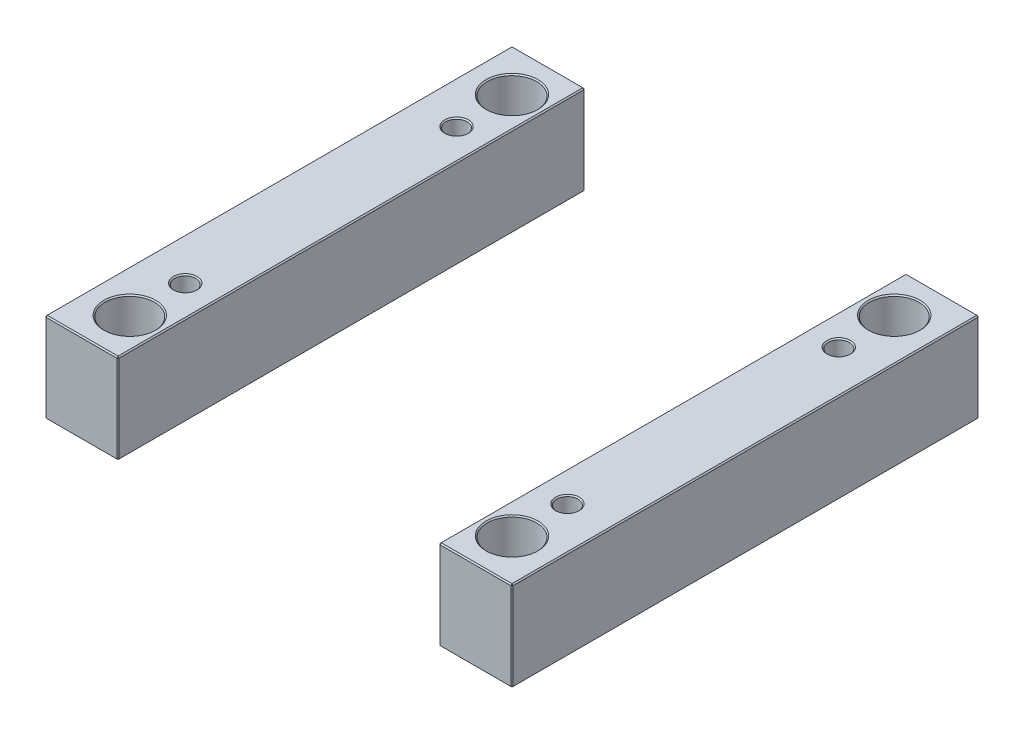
ISO-10303-21;
HEADER;
FILE_DESCRIPTION(('STEP AP214'),'2;1');
FILE_NAME('part.step','',(''),(''),'','','');
FILE_SCHEMA(('AUTOMOTIVE_DESIGN { 1 0 10303 214 1 1 1 1 }'));
ENDSEC;
DATA;
#1=APPLICATION_CONTEXT('core data for automotive mechanical design processes');
#2=APPLICATION_PROTOCOL_DEFINITION('international standard','automotive_design',2000,#1);
#3=PRODUCT_CONTEXT('',#1,'mechanical');
#4=PRODUCT('Part','Part','',(#3));
#5=PRODUCT_RELATED_PRODUCT_CATEGORY('part','',(#4));
#6=PRODUCT_DEFINITION_FORMATION('','',#4);
#7=PRODUCT_DEFINITION_CONTEXT('part definition',#1,'design');
#8=PRODUCT_DEFINITION('design','',#6,#7);
#9=PRODUCT_DEFINITION_SHAPE('','',#8);
#10=(LENGTH_UNIT() NAMED_UNIT(*) SI_UNIT(.MILLI.,.METRE.));
#11=(NAMED_UNIT(*) PLANE_ANGLE_UNIT() SI_UNIT($,.RADIAN.));
#12=(NAMED_UNIT(*) SI_UNIT($,.STERADIAN.) SOLID_ANGLE_UNIT());
#13=UNCERTAINTY_MEASURE_WITH_UNIT(LENGTH_MEASURE(1.E-05),#10,'distance_accuracy_value','');
#14=(GEOMETRIC_REPRESENTATION_CONTEXT(3) GLOBAL_UNCERTAINTY_ASSIGNED_CONTEXT((#13)) GLOBAL_UNIT_ASSIGNED_CONTEXT((#10,
#11,#12)) REPRESENTATION_CONTEXT('',''));
#15=CARTESIAN_POINT('',(0.,0.,0.));
#16=DIRECTION('',(0.,0.,1.));
#17=DIRECTION('',(1.,0.,0.));
#18=AXIS2_PLACEMENT_3D('',#15,#16,#17);
#19=CARTESIAN_POINT('',(-198.,76.,-198.));
#20=DIRECTION('',(0.,0.,1.));
#21=DIRECTION('',(1.,0.,0.));
#22=AXIS2_PLACEMENT_3D('',#19,#20,#21);
#23=PLANE('',#22);
#24=DIRECTION('',(-1.,0.,0.));
#25=VECTOR('',#24,1.);
#26=CARTESIAN_POINT('',(-198.,1.,-198.));
#27=LINE('',#26,#25);
#28=CARTESIAN_POINT('',(-137.,1.,-198.));
#29=VERTEX_POINT('',#28);
#30=CARTESIAN_POINT('',(-197.,1.,-198.));
#31=VERTEX_POINT('',#30);
#32=EDGE_CURVE('P0_E137',#29,#31,#27,.T.);
#33=ORIENTED_EDGE('',*,*,#32,.T.);
#34=DIRECTION('',(0.,1.,0.));
#35=VECTOR('',#34,1.);
#36=CARTESIAN_POINT('',(-197.,76.,-198.));
#37=LINE('',#36,#35);
#38=CARTESIAN_POINT('',(-197.,75.,-198.));
#39=VERTEX_POINT('',#38);
#40=EDGE_CURVE('P0_E265',#31,#39,#37,.T.);
#41=ORIENTED_EDGE('',*,*,#40,.T.);
#42=DIRECTION('',(1.,0.,0.));
#43=VECTOR('',#42,1.);
#44=CARTESIAN_POINT('',(-198.,75.,-198.));
#45=LINE('',#44,#43);
#46=CARTESIAN_POINT('',(-137.,75.,-198.));
#47=VERTEX_POINT('',#46);
#48=EDGE_CURVE('P0_E263',#39,#47,#45,.T.);
#49=ORIENTED_EDGE('',*,*,#48,.T.);
#50=DIRECTION('',(0.,-1.,0.));
#51=VECTOR('',#50,1.);
#52=CARTESIAN_POINT('',(-137.,76.,-198.));
#53=LINE('',#52,#51);
#54=EDGE_CURVE('P0_E260',#47,#29,#53,.T.);
#55=ORIENTED_EDGE('',*,*,#54,.T.);
#56=EDGE_LOOP('',(#33,#41,#49,#55));
#57=FACE_BOUND('',#56,.T.);
#58=ADVANCED_FACE('P0_F16',(#57),#23,.F.);
#59=CARTESIAN_POINT('',(-198.,76.,198.));
#60=DIRECTION('',(1.,0.,0.));
#61=DIRECTION('',(0.,0.,-1.));
#62=AXIS2_PLACEMENT_3D('',#59,#60,#61);
#63=PLANE('',#62);
#64=DIRECTION('',(0.,1.,0.));
#65=VECTOR('',#64,1.);
#66=CARTESIAN_POINT('',(-198.,76.,197.));
#67=LINE('',#66,#65);
#68=CARTESIAN_POINT('',(-198.,1.,197.));
#69=VERTEX_POINT('',#68);
#70=CARTESIAN_POINT('',(-198.,75.,197.));
#71=VERTEX_POINT('',#70);
#72=EDGE_CURVE('P0_E253',#69,#71,#67,.T.);
#73=ORIENTED_EDGE('',*,*,#72,.T.);
#74=DIRECTION('',(0.,0.,-1.));
#75=VECTOR('',#74,1.);
#76=CARTESIAN_POINT('',(-198.,75.,198.));
#77=LINE('',#76,#75);
#78=CARTESIAN_POINT('',(-198.,75.,-197.));
#79=VERTEX_POINT('',#78);
#80=EDGE_CURVE('P0_E258',#71,#79,#77,.T.);
#81=ORIENTED_EDGE('',*,*,#80,.T.);
#82=DIRECTION('',(0.,-1.,0.));
#83=VECTOR('',#82,1.);
#84=CARTESIAN_POINT('',(-198.,76.,-197.));
#85=LINE('',#84,#83);
#86=CARTESIAN_POINT('',(-198.,1.,-197.));
#87=VERTEX_POINT('',#86);
#88=EDGE_CURVE('P0_E255',#79,#87,#85,.T.);
#89=ORIENTED_EDGE('',*,*,#88,.T.);
#90=DIRECTION('',(0.,0.,1.));
#91=VECTOR('',#90,1.);
#92=CARTESIAN_POINT('',(-198.,1.,198.));
#93=LINE('',#92,#91);
#94=EDGE_CURVE('P0_E251',#87,#69,#93,.T.);
#95=ORIENTED_EDGE('',*,*,#94,.T.);
#96=EDGE_LOOP('',(#73,#81,#89,#95));
#97=FACE_BOUND('',#96,.T.);
#98=ADVANCED_FACE('P0_F333',(#97),#63,.F.);
#99=CARTESIAN_POINT('',(-198.,76.,198.));
#100=DIRECTION('',(0.,0.,-1.));
#101=DIRECTION('',(-1.,0.,0.));
#102=AXIS2_PLACEMENT_3D('',#99,#100,#101);
#103=PLANE('',#102);
#104=DIRECTION('',(-1.,0.,0.));
#105=VECTOR('',#104,1.);
#106=CARTESIAN_POINT('',(-198.,75.,198.));
#107=LINE('',#106,#105);
#108=CARTESIAN_POINT('',(-137.,75.,198.));
#109=VERTEX_POINT('',#108);
#110=CARTESIAN_POINT('',(-197.,75.,198.));
#111=VERTEX_POINT('',#110);
#112=EDGE_CURVE('P0_E272',#109,#111,#107,.T.);
#113=ORIENTED_EDGE('',*,*,#112,.T.);
#114=DIRECTION('',(0.,-1.,0.));
#115=VECTOR('',#114,1.);
#116=CARTESIAN_POINT('',(-197.,76.,198.));
#117=LINE('',#116,#115);
#118=CARTESIAN_POINT('',(-197.,1.,198.));
#119=VERTEX_POINT('',#118);
#120=EDGE_CURVE('P0_E274',#111,#119,#117,.T.);
#121=ORIENTED_EDGE('',*,*,#120,.T.);
#122=DIRECTION('',(1.,0.,0.));
#123=VECTOR('',#122,1.);
#124=CARTESIAN_POINT('',(-136.,1.,198.));
#125=LINE('',#124,#123);
#126=CARTESIAN_POINT('',(-137.,1.,198.));
#127=VERTEX_POINT('',#126);
#128=EDGE_CURVE('P0_E270',#119,#127,#125,.T.);
#129=ORIENTED_EDGE('',*,*,#128,.T.);
#130=DIRECTION('',(0.,1.,0.));
#131=VECTOR('',#130,1.);
#132=CARTESIAN_POINT('',(-137.,76.,198.));
#133=LINE('',#132,#131);
#134=EDGE_CURVE('P0_E268',#127,#109,#133,.T.);
#135=ORIENTED_EDGE('',*,*,#134,.T.);
#136=EDGE_LOOP('',(#113,#121,#129,#135));
#137=FACE_BOUND('',#136,.T.);
#138=ADVANCED_FACE('P0_F372',(#137),#103,.F.);
#139=CARTESIAN_POINT('',(-136.,76.,-198.));
#140=DIRECTION('',(-1.,0.,0.));
#141=DIRECTION('',(0.,0.,1.));
#142=AXIS2_PLACEMENT_3D('',#139,#140,#141);
#143=PLANE('',#142);
#144=DIRECTION('',(0.,0.,1.));
#145=VECTOR('',#144,1.);
#146=CARTESIAN_POINT('',(-136.,75.,-198.));
#147=LINE('',#146,#145);
#148=CARTESIAN_POINT('',(-136.,75.,-197.));
#149=VERTEX_POINT('',#148);
#150=CARTESIAN_POINT('',(-136.,75.,197.));
#151=VERTEX_POINT('',#150);
#152=EDGE_CURVE('P0_E31',#149,#151,#147,.T.);
#153=ORIENTED_EDGE('',*,*,#152,.T.);
#154=DIRECTION('',(0.,-1.,0.));
#155=VECTOR('',#154,1.);
#156=CARTESIAN_POINT('',(-136.,76.,197.));
#157=LINE('',#156,#155);
#158=CARTESIAN_POINT('',(-136.,1.,197.));
#159=VERTEX_POINT('',#158);
#160=EDGE_CURVE('P0_E190',#151,#159,#157,.T.);
#161=ORIENTED_EDGE('',*,*,#160,.T.);
#162=DIRECTION('',(0.,0.,-1.));
#163=VECTOR('',#162,1.);
#164=CARTESIAN_POINT('',(-136.,1.,-198.));
#165=LINE('',#164,#163);
#166=CARTESIAN_POINT('',(-136.,1.,-197.));
#167=VERTEX_POINT('',#166);
#168=EDGE_CURVE('P0_E286',#159,#167,#165,.T.);
#169=ORIENTED_EDGE('',*,*,#168,.T.);
#170=DIRECTION('',(0.,1.,0.));
#171=VECTOR('',#170,1.);
#172=CARTESIAN_POINT('',(-136.,76.,-197.));
#173=LINE('',#172,#171);
#174=EDGE_CURVE('P0_E36',#167,#149,#173,.T.);
#175=ORIENTED_EDGE('',*,*,#174,.T.);
#176=EDGE_LOOP('',(#153,#161,#169,#175));
#177=FACE_BOUND('',#176,.T.);
#178=ADVANCED_FACE('P0_F649',(#177),#143,.F.);
#179=CARTESIAN_POINT('',(0.,76.,0.));
#180=DIRECTION('',(0.,-1.,0.));
#181=DIRECTION('',(0.,0.,-1.));
#182=AXIS2_PLACEMENT_3D('',#179,#180,#181);
#183=PLANE('',#182);
#184=CARTESIAN_POINT('',(-162.,76.,-162.));
#185=DIRECTION('',(0.,-1.,0.));
#186=DIRECTION('',(0.,0.,-1.));
#187=AXIS2_PLACEMENT_3D('',#184,#185,#186);
#188=CIRCLE('',#187,22.);
#189=CARTESIAN_POINT('',(-162.,76.,-184.));
#190=VERTEX_POINT('',#189);
#191=EDGE_CURVE('P0_E214',#190,#190,#188,.T.);
#192=ORIENTED_EDGE('',*,*,#191,.T.);
#193=EDGE_LOOP('',(#192));
#194=FACE_BOUND('',#193,.T.);
#195=CARTESIAN_POINT('',(-162.,76.,162.));
#196=DIRECTION('',(0.,-1.,0.));
#197=DIRECTION('',(0.,0.,-1.));
#198=AXIS2_PLACEMENT_3D('',#195,#196,#197);
#199=CIRCLE('',#198,22.);
#200=CARTESIAN_POINT('',(-162.,76.,140.));
#201=VERTEX_POINT('',#200);
#202=EDGE_CURVE('P0_E211',#201,#201,#199,.T.);
#203=ORIENTED_EDGE('',*,*,#202,.T.);
#204=EDGE_LOOP('',(#203));
#205=FACE_BOUND('',#204,.T.);
#206=CARTESIAN_POINT('',(-162.,76.,115.));
#207=DIRECTION('',(0.,-1.,0.));
#208=DIRECTION('',(0.,0.,-1.));
#209=AXIS2_PLACEMENT_3D('',#206,#207,#208);
#210=CIRCLE('',#209,10.);
#211=CARTESIAN_POINT('',(-162.,76.,105.));
#212=VERTEX_POINT('',#211);
#213=EDGE_CURVE('P0_E193',#212,#212,#210,.T.);
#214=ORIENTED_EDGE('',*,*,#213,.T.);
#215=EDGE_LOOP('',(#214));
#216=FACE_BOUND('',#215,.T.);
#217=CARTESIAN_POINT('',(-162.,76.,-115.));
#218=DIRECTION('',(0.,-1.,0.));
#219=DIRECTION('',(0.,0.,-1.));
#220=AXIS2_PLACEMENT_3D('',#217,#218,#219);
#221=CIRCLE('',#220,10.);
#222=CARTESIAN_POINT('',(-162.,76.,-125.));
#223=VERTEX_POINT('',#222);
#224=EDGE_CURVE('P0_E189',#223,#223,#221,.T.);
#225=ORIENTED_EDGE('',*,*,#224,.T.);
#226=EDGE_LOOP('',(#225));
#227=FACE_BOUND('',#226,.T.);
#228=DIRECTION('',(0.,0.,1.));
#229=VECTOR('',#228,1.);
#230=CARTESIAN_POINT('',(-197.,76.,0.));
#231=LINE('',#230,#229);
#232=CARTESIAN_POINT('',(-197.,76.,-197.));
#233=VERTEX_POINT('',#232);
#234=CARTESIAN_POINT('',(-197.,76.,197.));
#235=VERTEX_POINT('',#234);
#236=EDGE_CURVE('P0_E281',#233,#235,#231,.T.);
#237=ORIENTED_EDGE('',*,*,#236,.T.);
#238=DIRECTION('',(1.,0.,0.));
#239=VECTOR('',#238,1.);
#240=CARTESIAN_POINT('',(-1.76382206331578E-13,76.,197.));
#241=LINE('',#240,#239);
#242=CARTESIAN_POINT('',(-137.,76.,197.));
#243=VERTEX_POINT('',#242);
#244=EDGE_CURVE('P0_E283',#235,#243,#241,.T.);
#245=ORIENTED_EDGE('',*,*,#244,.T.);
#246=DIRECTION('',(0.,0.,-1.));
#247=VECTOR('',#246,1.);
#248=CARTESIAN_POINT('',(-137.,76.,0.));
#249=LINE('',#248,#247);
#250=CARTESIAN_POINT('',(-137.,76.,-197.));
#251=VERTEX_POINT('',#250);
#252=EDGE_CURVE('P0_E277',#243,#251,#249,.T.);
#253=ORIENTED_EDGE('',*,*,#252,.T.);
#254=DIRECTION('',(-1.,0.,0.));
#255=VECTOR('',#254,1.);
#256=CARTESIAN_POINT('',(1.76382206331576E-13,76.,-197.));
#257=LINE('',#256,#255);
#258=EDGE_CURVE('P0_E279',#251,#233,#257,.T.);
#259=ORIENTED_EDGE('',*,*,#258,.T.);
#260=EDGE_LOOP('',(#237,#245,#253,#259));
#261=FACE_BOUND('',#260,.T.);
#262=ADVANCED_FACE('P0_F229',(#194,#205,#216,#227,#261),#183,.F.);
#263=CARTESIAN_POINT('',(0.,0.,0.));
#264=DIRECTION('',(0.,-1.,0.));
#265=DIRECTION('',(0.,0.,-1.));
#266=AXIS2_PLACEMENT_3D('',#263,#264,#265);
#267=PLANE('',#266);
#268=CARTESIAN_POINT('',(-162.,0.,-162.));
#269=DIRECTION('',(0.,-1.,0.));
#270=DIRECTION('',(0.,0.,-1.));
#271=AXIS2_PLACEMENT_3D('',#268,#269,#270);
#272=CIRCLE('',#271,22.);
#273=CARTESIAN_POINT('',(-162.,0.,-184.));
#274=VERTEX_POINT('',#273);
#275=EDGE_CURVE('P0_E202',#274,#274,#272,.F.);
#276=ORIENTED_EDGE('',*,*,#275,.T.);
#277=EDGE_LOOP('',(#276));
#278=FACE_BOUND('',#277,.T.);
#279=CARTESIAN_POINT('',(-162.,0.,162.));
#280=DIRECTION('',(0.,-1.,0.));
#281=DIRECTION('',(0.,0.,-1.));
#282=AXIS2_PLACEMENT_3D('',#279,#280,#281);
#283=CIRCLE('',#282,22.);
#284=CARTESIAN_POINT('',(-162.,0.,140.));
#285=VERTEX_POINT('',#284);
#286=EDGE_CURVE('P0_E199',#285,#285,#283,.F.);
#287=ORIENTED_EDGE('',*,*,#286,.T.);
#288=EDGE_LOOP('',(#287));
#289=FACE_BOUND('',#288,.T.);
#290=CARTESIAN_POINT('',(-162.,0.,-115.));
#291=DIRECTION('',(0.,-1.,0.));
#292=DIRECTION('',(0.,0.,-1.));
#293=AXIS2_PLACEMENT_3D('',#290,#291,#292);
#294=CIRCLE('',#293,10.);
#295=CARTESIAN_POINT('',(-162.,0.,-125.));
#296=VERTEX_POINT('',#295);
#297=EDGE_CURVE('P0_E235',#296,#296,#294,.F.);
#298=ORIENTED_EDGE('',*,*,#297,.T.);
#299=EDGE_LOOP('',(#298));
#300=FACE_BOUND('',#299,.T.);
#301=CARTESIAN_POINT('',(-162.,0.,115.));
#302=DIRECTION('',(0.,-1.,0.));
#303=DIRECTION('',(0.,0.,-1.));
#304=AXIS2_PLACEMENT_3D('',#301,#302,#303);
#305=CIRCLE('',#304,10.);
#306=CARTESIAN_POINT('',(-162.,0.,105.));
#307=VERTEX_POINT('',#306);
#308=EDGE_CURVE('P0_E238',#307,#307,#305,.F.);
#309=ORIENTED_EDGE('',*,*,#308,.T.);
#310=EDGE_LOOP('',(#309));
#311=FACE_BOUND('',#310,.T.);
#312=DIRECTION('',(-1.,0.,0.));
#313=VECTOR('',#312,1.);
#314=CARTESIAN_POINT('',(-198.,0.,197.));
#315=LINE('',#314,#313);
#316=CARTESIAN_POINT('',(-137.,0.,197.));
#317=VERTEX_POINT('',#316);
#318=CARTESIAN_POINT('',(-197.,0.,197.));
#319=VERTEX_POINT('',#318);
#320=EDGE_CURVE('P0_E114',#317,#319,#315,.T.);
#321=ORIENTED_EDGE('',*,*,#320,.T.);
#322=DIRECTION('',(0.,0.,-1.));
#323=VECTOR('',#322,1.);
#324=CARTESIAN_POINT('',(-197.,0.,-198.));
#325=LINE('',#324,#323);
#326=CARTESIAN_POINT('',(-197.,0.,-197.));
#327=VERTEX_POINT('',#326);
#328=EDGE_CURVE('P0_E110',#319,#327,#325,.T.);
#329=ORIENTED_EDGE('',*,*,#328,.T.);
#330=DIRECTION('',(1.,0.,0.));
#331=VECTOR('',#330,1.);
#332=CARTESIAN_POINT('',(-136.,0.,-197.));
#333=LINE('',#332,#331);
#334=CARTESIAN_POINT('',(-137.,0.,-197.));
#335=VERTEX_POINT('',#334);
#336=EDGE_CURVE('P0_E104',#327,#335,#333,.T.);
#337=ORIENTED_EDGE('',*,*,#336,.T.);
#338=DIRECTION('',(0.,0.,1.));
#339=VECTOR('',#338,1.);
#340=CARTESIAN_POINT('',(-137.,0.,198.));
#341=LINE('',#340,#339);
#342=EDGE_CURVE('P0_E107',#335,#317,#341,.T.);
#343=ORIENTED_EDGE('',*,*,#342,.T.);
#344=EDGE_LOOP('',(#321,#329,#337,#343));
#345=FACE_BOUND('',#344,.T.);
#346=ADVANCED_FACE('P0_F106',(#278,#289,#300,#311,#345),#267,.T.);
#347=CARTESIAN_POINT('',(-162.,0.,-115.));
#348=DIRECTION('',(0.,1.,0.));
#349=DIRECTION('',(0.,0.,1.));
#350=AXIS2_PLACEMENT_3D('',#347,#348,#349);
#351=CYLINDRICAL_SURFACE('',#350,9.);
#352=CARTESIAN_POINT('',(-162.,75.,-115.));
#353=DIRECTION('',(0.,-1.,0.));
#354=DIRECTION('',(0.,0.,-1.));
#355=AXIS2_PLACEMENT_3D('',#352,#353,#354);
#356=CIRCLE('',#355,9.);
#357=CARTESIAN_POINT('',(-162.,75.,-124.));
#358=VERTEX_POINT('',#357);
#359=EDGE_CURVE('P0_E196',#358,#358,#356,.F.);
#360=ORIENTED_EDGE('',*,*,#359,.T.);
#361=EDGE_LOOP('',(#360));
#362=FACE_BOUND('',#361,.T.);
#363=CARTESIAN_POINT('',(-162.,1.00000000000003,-115.));
#364=DIRECTION('',(0.,-1.,0.));
#365=DIRECTION('',(0.,0.,-1.));
#366=AXIS2_PLACEMENT_3D('',#363,#364,#365);
#367=CIRCLE('',#366,9.);
#368=CARTESIAN_POINT('',(-162.,1.00000000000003,-124.));
#369=VERTEX_POINT('',#368);
#370=EDGE_CURVE('P0_E241',#369,#369,#367,.T.);
#371=ORIENTED_EDGE('',*,*,#370,.T.);
#372=EDGE_LOOP('',(#371));
#373=FACE_BOUND('',#372,.T.);
#374=ADVANCED_FACE('P0_F228',(#362,#373),#351,.F.);
#375=CARTESIAN_POINT('',(-162.,0.,115.));
#376=DIRECTION('',(0.,1.,0.));
#377=DIRECTION('',(0.,0.,1.));
#378=AXIS2_PLACEMENT_3D('',#375,#376,#377);
#379=CYLINDRICAL_SURFACE('',#378,9.);
#380=CARTESIAN_POINT('',(-162.,75.,115.));
#381=DIRECTION('',(0.,-1.,0.));
#382=DIRECTION('',(0.,0.,-1.));
#383=AXIS2_PLACEMENT_3D('',#380,#381,#382);
#384=CIRCLE('',#383,9.);
#385=CARTESIAN_POINT('',(-162.,75.,106.));
#386=VERTEX_POINT('',#385);
#387=EDGE_CURVE('P0_E186',#386,#386,#384,.F.);
#388=ORIENTED_EDGE('',*,*,#387,.T.);
#389=EDGE_LOOP('',(#388));
#390=FACE_BOUND('',#389,.T.);
#391=CARTESIAN_POINT('',(-162.,1.00000000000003,115.));
#392=DIRECTION('',(0.,-1.,0.));
#393=DIRECTION('',(0.,0.,-1.));
#394=AXIS2_PLACEMENT_3D('',#391,#392,#393);
#395=CIRCLE('',#394,9.);
#396=CARTESIAN_POINT('',(-162.,1.00000000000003,106.));
#397=VERTEX_POINT('',#396);
#398=EDGE_CURVE('P0_E248',#397,#397,#395,.T.);
#399=ORIENTED_EDGE('',*,*,#398,.T.);
#400=EDGE_LOOP('',(#399));
#401=FACE_BOUND('',#400,.T.);
#402=ADVANCED_FACE('P0_F380',(#390,#401),#379,.F.);
#403=CARTESIAN_POINT('',(-162.,0.,-115.));
#404=DIRECTION('',(0.,-1.,0.));
#405=DIRECTION('',(0.,0.,-1.));
#406=AXIS2_PLACEMENT_3D('',#403,#404,#405);
#407=CONICAL_SURFACE('',#406,10.,0.78539816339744);
#408=ORIENTED_EDGE('',*,*,#370,.F.);
#409=EDGE_LOOP('',(#408));
#410=FACE_BOUND('',#409,.T.);
#411=ORIENTED_EDGE('',*,*,#297,.F.);
#412=EDGE_LOOP('',(#411));
#413=FACE_BOUND('',#412,.T.);
#414=ADVANCED_FACE('P0_F376',(#410,#413),#407,.F.);
#415=CARTESIAN_POINT('',(-162.,0.,115.));
#416=DIRECTION('',(0.,-1.,0.));
#417=DIRECTION('',(0.,0.,-1.));
#418=AXIS2_PLACEMENT_3D('',#415,#416,#417);
#419=CONICAL_SURFACE('',#418,10.,0.785398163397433);
#420=ORIENTED_EDGE('',*,*,#398,.F.);
#421=EDGE_LOOP('',(#420));
#422=FACE_BOUND('',#421,.T.);
#423=ORIENTED_EDGE('',*,*,#308,.F.);
#424=EDGE_LOOP('',(#423));
#425=FACE_BOUND('',#424,.T.);
#426=ADVANCED_FACE('P0_F379',(#422,#425),#419,.F.);
#427=CARTESIAN_POINT('',(-136.,76.,197.));
#428=DIRECTION('',(-0.707106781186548,0.,-0.707106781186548));
#429=DIRECTION('',(0.,-1.,0.));
#430=AXIS2_PLACEMENT_3D('',#427,#428,#429);
#431=PLANE('',#430);
#432=DIRECTION('',(-0.707106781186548,0.,0.707106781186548));
#433=VECTOR('',#432,1.);
#434=CARTESIAN_POINT('',(-136.5,75.,197.5));
#435=LINE('',#434,#433);
#436=EDGE_CURVE('P0_E125',#109,#151,#435,.F.);
#437=ORIENTED_EDGE('',*,*,#436,.F.);
#438=ORIENTED_EDGE('',*,*,#134,.F.);
#439=DIRECTION('',(0.707106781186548,0.,-0.707106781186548));
#440=VECTOR('',#439,1.);
#441=CARTESIAN_POINT('',(-137.,1.,198.));
#442=LINE('',#441,#440);
#443=EDGE_CURVE('P0_E181',#159,#127,#442,.F.);
#444=ORIENTED_EDGE('',*,*,#443,.F.);
#445=ORIENTED_EDGE('',*,*,#160,.F.);
#446=EDGE_LOOP('',(#437,#438,#444,#445));
#447=FACE_BOUND('',#446,.T.);
#448=ADVANCED_FACE('P0_F384',(#447),#431,.F.);
#449=CARTESIAN_POINT('',(-137.,76.,197.));
#450=DIRECTION('',(0.577350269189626,0.577350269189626,0.577350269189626));
#451=DIRECTION('',(0.707106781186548,0.,-0.707106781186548));
#452=AXIS2_PLACEMENT_3D('',#449,#450,#451);
#453=PLANE('',#452);
#454=DIRECTION('',(0.,0.707106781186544,-0.707106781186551));
#455=VECTOR('',#454,1.);
#456=CARTESIAN_POINT('',(-137.,76.,197.));
#457=LINE('',#456,#455);
#458=EDGE_CURVE('P0_E175',#109,#243,#457,.T.);
#459=ORIENTED_EDGE('',*,*,#458,.F.);
#460=ORIENTED_EDGE('',*,*,#436,.T.);
#461=DIRECTION('',(0.707106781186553,-0.707106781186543,0.));
#462=VECTOR('',#461,1.);
#463=CARTESIAN_POINT('',(-137.,76.,197.));
#464=LINE('',#463,#462);
#465=EDGE_CURVE('P0_E178',#243,#151,#464,.T.);
#466=ORIENTED_EDGE('',*,*,#465,.F.);
#467=EDGE_LOOP('',(#459,#460,#466));
#468=FACE_BOUND('',#467,.T.);
#469=ADVANCED_FACE('P0_F588',(#468),#453,.T.);
#470=CARTESIAN_POINT('',(-137.,1.,198.));
#471=DIRECTION('',(0.57735026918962,-0.577350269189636,0.57735026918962));
#472=DIRECTION('',(0.,-0.707106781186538,-0.707106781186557));
#473=AXIS2_PLACEMENT_3D('',#470,#471,#472);
#474=PLANE('',#473);
#475=DIRECTION('',(0.707106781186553,0.707106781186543,0.));
#476=VECTOR('',#475,1.);
#477=CARTESIAN_POINT('',(-136.5,0.500000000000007,197.));
#478=LINE('',#477,#476);
#479=EDGE_CURVE('P0_E123',#159,#317,#478,.F.);
#480=ORIENTED_EDGE('',*,*,#479,.F.);
#481=ORIENTED_EDGE('',*,*,#443,.T.);
#482=DIRECTION('',(0.,-0.707106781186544,-0.707106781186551));
#483=VECTOR('',#482,1.);
#484=CARTESIAN_POINT('',(-137.,1.,198.));
#485=LINE('',#484,#483);
#486=EDGE_CURVE('P0_E172',#317,#127,#485,.F.);
#487=ORIENTED_EDGE('',*,*,#486,.F.);
#488=EDGE_LOOP('',(#480,#481,#487));
#489=FACE_BOUND('',#488,.T.);
#490=ADVANCED_FACE('P0_F597',(#489),#474,.T.);
#491=CARTESIAN_POINT('',(-137.,76.,0.));
#492=DIRECTION('',(-0.707106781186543,-0.707106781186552,0.));
#493=DIRECTION('',(0.,0.,-1.));
#494=AXIS2_PLACEMENT_3D('',#491,#492,#493);
#495=PLANE('',#494);
#496=ORIENTED_EDGE('',*,*,#465,.T.);
#497=ORIENTED_EDGE('',*,*,#152,.F.);
#498=DIRECTION('',(-0.707106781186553,0.707106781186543,0.));
#499=VECTOR('',#498,1.);
#500=CARTESIAN_POINT('',(-136.5,75.5,-197.));
#501=LINE('',#500,#499);
#502=EDGE_CURVE('P0_E165',#251,#149,#501,.F.);
#503=ORIENTED_EDGE('',*,*,#502,.F.);
#504=ORIENTED_EDGE('',*,*,#252,.F.);
#505=EDGE_LOOP('',(#496,#497,#503,#504));
#506=FACE_BOUND('',#505,.T.);
#507=ADVANCED_FACE('P0_F349',(#506),#495,.F.);
#508=CARTESIAN_POINT('',(-1.76382206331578E-13,76.,197.));
#509=DIRECTION('',(0.,-0.707106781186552,-0.707106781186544));
#510=DIRECTION('',(1.,0.,0.));
#511=AXIS2_PLACEMENT_3D('',#508,#509,#510);
#512=PLANE('',#511);
#513=ORIENTED_EDGE('',*,*,#458,.T.);
#514=ORIENTED_EDGE('',*,*,#244,.F.);
#515=DIRECTION('',(0.,-0.707106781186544,0.707106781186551));
#516=VECTOR('',#515,1.);
#517=CARTESIAN_POINT('',(-197.,75.5,197.5));
#518=LINE('',#517,#516);
#519=EDGE_CURVE('P0_E162',#111,#235,#518,.F.);
#520=ORIENTED_EDGE('',*,*,#519,.F.);
#521=ORIENTED_EDGE('',*,*,#112,.F.);
#522=EDGE_LOOP('',(#513,#514,#520,#521));
#523=FACE_BOUND('',#522,.T.);
#524=ADVANCED_FACE('P0_F344',(#523),#512,.F.);
#525=CARTESIAN_POINT('',(-197.,76.,198.));
#526=DIRECTION('',(0.707106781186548,0.,-0.707106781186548));
#527=DIRECTION('',(0.,-1.,0.));
#528=AXIS2_PLACEMENT_3D('',#525,#526,#527);
#529=PLANE('',#528);
#530=DIRECTION('',(0.707106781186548,0.,0.707106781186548));
#531=VECTOR('',#530,1.);
#532=CARTESIAN_POINT('',(-197.,1.,198.));
#533=LINE('',#532,#531);
#534=EDGE_CURVE('P0_E156',#119,#69,#533,.F.);
#535=ORIENTED_EDGE('',*,*,#534,.F.);
#536=ORIENTED_EDGE('',*,*,#120,.F.);
#537=DIRECTION('',(-0.707106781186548,0.,-0.707106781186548));
#538=VECTOR('',#537,1.);
#539=CARTESIAN_POINT('',(-198.,75.,197.));
#540=LINE('',#539,#538);
#541=EDGE_CURVE('P0_E159',#71,#111,#540,.F.);
#542=ORIENTED_EDGE('',*,*,#541,.F.);
#543=ORIENTED_EDGE('',*,*,#72,.F.);
#544=EDGE_LOOP('',(#535,#536,#542,#543));
#545=FACE_BOUND('',#544,.T.);
#546=ADVANCED_FACE('P0_F338',(#545),#529,.F.);
#547=CARTESIAN_POINT('',(-198.,1.,198.));
#548=DIRECTION('',(0.,-0.707106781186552,0.707106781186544));
#549=DIRECTION('',(-1.,0.,0.));
#550=AXIS2_PLACEMENT_3D('',#547,#548,#549);
#551=PLANE('',#550);
#552=ORIENTED_EDGE('',*,*,#486,.T.);
#553=ORIENTED_EDGE('',*,*,#128,.F.);
#554=DIRECTION('',(0.,0.707106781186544,0.707106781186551));
#555=VECTOR('',#554,1.);
#556=CARTESIAN_POINT('',(-197.,1.,198.));
#557=LINE('',#556,#555);
#558=EDGE_CURVE('P0_E134',#319,#119,#557,.T.);
#559=ORIENTED_EDGE('',*,*,#558,.F.);
#560=ORIENTED_EDGE('',*,*,#320,.F.);
#561=EDGE_LOOP('',(#552,#553,#559,#560));
#562=FACE_BOUND('',#561,.T.);
#563=ADVANCED_FACE('P0_F364',(#562),#551,.T.);
#564=CARTESIAN_POINT('',(-136.,1.,-198.));
#565=DIRECTION('',(0.707106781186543,-0.707106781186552,0.));
#566=DIRECTION('',(0.,0.,1.));
#567=AXIS2_PLACEMENT_3D('',#564,#565,#566);
#568=PLANE('',#567);
#569=ORIENTED_EDGE('',*,*,#479,.T.);
#570=ORIENTED_EDGE('',*,*,#342,.F.);
#571=DIRECTION('',(-0.707106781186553,-0.707106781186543,0.));
#572=VECTOR('',#571,1.);
#573=CARTESIAN_POINT('',(-137.,0.,-197.));
#574=LINE('',#573,#572);
#575=EDGE_CURVE('P0_E120',#167,#335,#574,.T.);
#576=ORIENTED_EDGE('',*,*,#575,.F.);
#577=ORIENTED_EDGE('',*,*,#168,.F.);
#578=EDGE_LOOP('',(#569,#570,#576,#577));
#579=FACE_BOUND('',#578,.T.);
#580=ADVANCED_FACE('P0_F119',(#579),#568,.T.);
#581=CARTESIAN_POINT('',(-137.,76.,-198.));
#582=DIRECTION('',(-0.707106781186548,0.,0.707106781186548));
#583=DIRECTION('',(0.,-1.,0.));
#584=AXIS2_PLACEMENT_3D('',#581,#582,#583);
#585=PLANE('',#584);
#586=DIRECTION('',(0.707106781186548,0.,0.707106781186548));
#587=VECTOR('',#586,1.);
#588=CARTESIAN_POINT('',(-137.,75.,-198.));
#589=LINE('',#588,#587);
#590=EDGE_CURVE('P0_E168',#149,#47,#589,.F.);
#591=ORIENTED_EDGE('',*,*,#590,.F.);
#592=ORIENTED_EDGE('',*,*,#174,.F.);
#593=DIRECTION('',(-0.707106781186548,0.,-0.707106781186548));
#594=VECTOR('',#593,1.);
#595=CARTESIAN_POINT('',(-136.5,1.,-197.5));
#596=LINE('',#595,#594);
#597=EDGE_CURVE('P0_E133',#29,#167,#596,.F.);
#598=ORIENTED_EDGE('',*,*,#597,.F.);
#599=ORIENTED_EDGE('',*,*,#54,.F.);
#600=EDGE_LOOP('',(#591,#592,#598,#599));
#601=FACE_BOUND('',#600,.T.);
#602=ADVANCED_FACE('P0_F354',(#601),#585,.F.);
#603=CARTESIAN_POINT('',(-137.,75.,-198.));
#604=DIRECTION('',(0.577350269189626,0.577350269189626,-0.577350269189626));
#605=DIRECTION('',(-0.707106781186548,0.,-0.707106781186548));
#606=AXIS2_PLACEMENT_3D('',#603,#604,#605);
#607=PLANE('',#606);
#608=ORIENTED_EDGE('',*,*,#502,.T.);
#609=ORIENTED_EDGE('',*,*,#590,.T.);
#610=DIRECTION('',(0.,-0.707106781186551,-0.707106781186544));
#611=VECTOR('',#610,1.);
#612=CARTESIAN_POINT('',(-137.,75.,-198.));
#613=LINE('',#612,#611);
#614=EDGE_CURVE('P0_E151',#251,#47,#613,.T.);
#615=ORIENTED_EDGE('',*,*,#614,.F.);
#616=EDGE_LOOP('',(#608,#609,#615));
#617=FACE_BOUND('',#616,.T.);
#618=ADVANCED_FACE('P0_F352',(#617),#607,.T.);
#619=CARTESIAN_POINT('',(-198.,75.,197.));
#620=DIRECTION('',(-0.577350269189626,0.577350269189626,0.577350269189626));
#621=DIRECTION('',(0.707106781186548,0.,0.707106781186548));
#622=AXIS2_PLACEMENT_3D('',#619,#620,#621);
#623=PLANE('',#622);
#624=ORIENTED_EDGE('',*,*,#541,.T.);
#625=ORIENTED_EDGE('',*,*,#519,.T.);
#626=DIRECTION('',(0.707106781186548,0.707106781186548,0.));
#627=VECTOR('',#626,1.);
#628=CARTESIAN_POINT('',(-198.,75.,197.));
#629=LINE('',#628,#627);
#630=EDGE_CURVE('P0_E142',#71,#235,#629,.T.);
#631=ORIENTED_EDGE('',*,*,#630,.F.);
#632=EDGE_LOOP('',(#624,#625,#631));
#633=FACE_BOUND('',#632,.T.);
#634=ADVANCED_FACE('P0_F341',(#633),#623,.T.);
#635=CARTESIAN_POINT('',(-197.,1.,198.));
#636=DIRECTION('',(-0.577350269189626,-0.577350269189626,0.577350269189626));
#637=DIRECTION('',(0.707106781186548,0.,0.707106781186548));
#638=AXIS2_PLACEMENT_3D('',#635,#636,#637);
#639=PLANE('',#638);
#640=ORIENTED_EDGE('',*,*,#558,.T.);
#641=ORIENTED_EDGE('',*,*,#534,.T.);
#642=DIRECTION('',(0.707106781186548,-0.707106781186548,0.));
#643=VECTOR('',#642,1.);
#644=CARTESIAN_POINT('',(-197.5,0.5,197.));
#645=LINE('',#644,#643);
#646=EDGE_CURVE('P0_E138',#319,#69,#645,.F.);
#647=ORIENTED_EDGE('',*,*,#646,.F.);
#648=EDGE_LOOP('',(#640,#641,#647));
#649=FACE_BOUND('',#648,.T.);
#650=ADVANCED_FACE('P0_F403',(#649),#639,.T.);
#651=CARTESIAN_POINT('',(-137.,0.,-197.));
#652=DIRECTION('',(0.57735026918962,-0.577350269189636,-0.57735026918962));
#653=DIRECTION('',(0.,0.707106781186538,-0.707106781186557));
#654=AXIS2_PLACEMENT_3D('',#651,#652,#653);
#655=PLANE('',#654);
#656=ORIENTED_EDGE('',*,*,#597,.T.);
#657=ORIENTED_EDGE('',*,*,#575,.T.);
#658=DIRECTION('',(0.,0.707106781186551,-0.707106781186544));
#659=VECTOR('',#658,1.);
#660=CARTESIAN_POINT('',(-137.,0.,-197.));
#661=LINE('',#660,#659);
#662=EDGE_CURVE('P0_E130',#29,#335,#661,.F.);
#663=ORIENTED_EDGE('',*,*,#662,.F.);
#664=EDGE_LOOP('',(#656,#657,#663));
#665=FACE_BOUND('',#664,.T.);
#666=ADVANCED_FACE('P0_F129',(#665),#655,.T.);
#667=CARTESIAN_POINT('',(1.76382206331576E-13,76.,-197.));
#668=DIRECTION('',(0.,-0.707106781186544,0.707106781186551));
#669=DIRECTION('',(-1.,0.,0.));
#670=AXIS2_PLACEMENT_3D('',#667,#668,#669);
#671=PLANE('',#670);
#672=ORIENTED_EDGE('',*,*,#614,.T.);
#673=ORIENTED_EDGE('',*,*,#48,.F.);
#674=DIRECTION('',(0.,0.707106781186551,0.707106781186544));
#675=VECTOR('',#674,1.);
#676=CARTESIAN_POINT('',(-197.,75.,-198.));
#677=LINE('',#676,#675);
#678=EDGE_CURVE('P0_E139',#233,#39,#677,.F.);
#679=ORIENTED_EDGE('',*,*,#678,.F.);
#680=ORIENTED_EDGE('',*,*,#258,.F.);
#681=EDGE_LOOP('',(#672,#673,#679,#680));
#682=FACE_BOUND('',#681,.T.);
#683=ADVANCED_FACE('P0_F316',(#682),#671,.F.);
#684=CARTESIAN_POINT('',(-197.,76.,0.));
#685=DIRECTION('',(0.707106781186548,-0.707106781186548,0.));
#686=DIRECTION('',(0.,0.,1.));
#687=AXIS2_PLACEMENT_3D('',#684,#685,#686);
#688=PLANE('',#687);
#689=ORIENTED_EDGE('',*,*,#630,.T.);
#690=ORIENTED_EDGE('',*,*,#236,.F.);
#691=DIRECTION('',(-0.707106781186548,-0.707106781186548,0.));
#692=VECTOR('',#691,1.);
#693=CARTESIAN_POINT('',(-197.5,75.5,-197.));
#694=LINE('',#693,#692);
#695=EDGE_CURVE('P0_E145',#79,#233,#694,.F.);
#696=ORIENTED_EDGE('',*,*,#695,.F.);
#697=ORIENTED_EDGE('',*,*,#80,.F.);
#698=EDGE_LOOP('',(#689,#690,#696,#697));
#699=FACE_BOUND('',#698,.T.);
#700=ADVANCED_FACE('P0_F310',(#699),#688,.F.);
#701=CARTESIAN_POINT('',(-198.,1.,198.));
#702=DIRECTION('',(-0.707106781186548,-0.707106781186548,0.));
#703=DIRECTION('',(0.,0.,-1.));
#704=AXIS2_PLACEMENT_3D('',#701,#702,#703);
#705=PLANE('',#704);
#706=ORIENTED_EDGE('',*,*,#646,.T.);
#707=ORIENTED_EDGE('',*,*,#94,.F.);
#708=DIRECTION('',(-0.707106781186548,0.707106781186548,0.));
#709=VECTOR('',#708,1.);
#710=CARTESIAN_POINT('',(-198.,1.,-197.));
#711=LINE('',#710,#709);
#712=EDGE_CURVE('P0_E297',#327,#87,#711,.T.);
#713=ORIENTED_EDGE('',*,*,#712,.F.);
#714=ORIENTED_EDGE('',*,*,#328,.F.);
#715=EDGE_LOOP('',(#706,#707,#713,#714));
#716=FACE_BOUND('',#715,.T.);
#717=ADVANCED_FACE('P0_F329',(#716),#705,.T.);
#718=CARTESIAN_POINT('',(-198.,1.,-198.));
#719=DIRECTION('',(0.,-0.707106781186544,-0.707106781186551));
#720=DIRECTION('',(1.,0.,0.));
#721=AXIS2_PLACEMENT_3D('',#718,#719,#720);
#722=PLANE('',#721);
#723=ORIENTED_EDGE('',*,*,#662,.T.);
#724=ORIENTED_EDGE('',*,*,#336,.F.);
#725=DIRECTION('',(0.,-0.707106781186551,0.707106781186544));
#726=VECTOR('',#725,1.);
#727=CARTESIAN_POINT('',(-197.,0.500000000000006,-197.5));
#728=LINE('',#727,#726);
#729=EDGE_CURVE('P0_E295',#31,#327,#728,.T.);
#730=ORIENTED_EDGE('',*,*,#729,.F.);
#731=ORIENTED_EDGE('',*,*,#32,.F.);
#732=EDGE_LOOP('',(#723,#724,#730,#731));
#733=FACE_BOUND('',#732,.T.);
#734=ADVANCED_FACE('P0_F136',(#733),#722,.T.);
#735=CARTESIAN_POINT('',(-197.,75.,-198.));
#736=DIRECTION('',(-0.577350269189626,0.577350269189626,-0.577350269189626));
#737=DIRECTION('',(-0.707106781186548,0.,0.707106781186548));
#738=AXIS2_PLACEMENT_3D('',#735,#736,#737);
#739=PLANE('',#738);
#740=ORIENTED_EDGE('',*,*,#695,.T.);
#741=ORIENTED_EDGE('',*,*,#678,.T.);
#742=DIRECTION('',(0.707106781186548,0.,-0.707106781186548));
#743=VECTOR('',#742,1.);
#744=CARTESIAN_POINT('',(-197.,75.,-198.));
#745=LINE('',#744,#743);
#746=EDGE_CURVE('P0_E293',#79,#39,#745,.T.);
#747=ORIENTED_EDGE('',*,*,#746,.F.);
#748=EDGE_LOOP('',(#740,#741,#747));
#749=FACE_BOUND('',#748,.T.);
#750=ADVANCED_FACE('P0_F303',(#749),#739,.T.);
#751=CARTESIAN_POINT('',(-198.,1.,-197.));
#752=DIRECTION('',(-0.577350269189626,-0.577350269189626,-0.577350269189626));
#753=DIRECTION('',(-0.707106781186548,0.,0.707106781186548));
#754=AXIS2_PLACEMENT_3D('',#751,#752,#753);
#755=PLANE('',#754);
#756=ORIENTED_EDGE('',*,*,#729,.T.);
#757=ORIENTED_EDGE('',*,*,#712,.T.);
#758=DIRECTION('',(-0.707106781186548,0.,0.707106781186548));
#759=VECTOR('',#758,1.);
#760=CARTESIAN_POINT('',(-198.,1.,-197.));
#761=LINE('',#760,#759);
#762=EDGE_CURVE('P0_E291',#31,#87,#761,.T.);
#763=ORIENTED_EDGE('',*,*,#762,.F.);
#764=EDGE_LOOP('',(#756,#757,#763));
#765=FACE_BOUND('',#764,.T.);
#766=ADVANCED_FACE('P0_F325',(#765),#755,.T.);
#767=CARTESIAN_POINT('',(-198.,76.,-197.));
#768=DIRECTION('',(0.707106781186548,0.,0.707106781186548));
#769=DIRECTION('',(0.,-1.,0.));
#770=AXIS2_PLACEMENT_3D('',#767,#768,#769);
#771=PLANE('',#770);
#772=ORIENTED_EDGE('',*,*,#746,.T.);
#773=ORIENTED_EDGE('',*,*,#40,.F.);
#774=ORIENTED_EDGE('',*,*,#762,.T.);
#775=ORIENTED_EDGE('',*,*,#88,.F.);
#776=EDGE_LOOP('',(#772,#773,#774,#775));
#777=FACE_BOUND('',#776,.T.);
#778=ADVANCED_FACE('P0_F323',(#777),#771,.F.);
#779=CARTESIAN_POINT('',(-162.,75.,115.));
#780=DIRECTION('',(0.,1.,0.));
#781=DIRECTION('',(0.,0.,1.));
#782=AXIS2_PLACEMENT_3D('',#779,#780,#781);
#783=CONICAL_SURFACE('',#782,9.,0.78539816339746);
#784=ORIENTED_EDGE('',*,*,#213,.F.);
#785=EDGE_LOOP('',(#784));
#786=FACE_BOUND('',#785,.T.);
#787=ORIENTED_EDGE('',*,*,#387,.F.);
#788=EDGE_LOOP('',(#787));
#789=FACE_BOUND('',#788,.T.);
#790=ADVANCED_FACE('P0_F388',(#786,#789),#783,.F.);
#791=CARTESIAN_POINT('',(-162.,75.,-115.));
#792=DIRECTION('',(0.,1.,0.));
#793=DIRECTION('',(0.,0.,1.));
#794=AXIS2_PLACEMENT_3D('',#791,#792,#793);
#795=CONICAL_SURFACE('',#794,9.,0.785398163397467);
#796=ORIENTED_EDGE('',*,*,#224,.F.);
#797=EDGE_LOOP('',(#796));
#798=FACE_BOUND('',#797,.T.);
#799=ORIENTED_EDGE('',*,*,#359,.F.);
#800=EDGE_LOOP('',(#799));
#801=FACE_BOUND('',#800,.T.);
#802=ADVANCED_FACE('P0_F470',(#798,#801),#795,.F.);
#803=CARTESIAN_POINT('',(-162.,0.,162.));
#804=DIRECTION('',(0.,1.,0.));
#805=DIRECTION('',(0.,0.,1.));
#806=AXIS2_PLACEMENT_3D('',#803,#804,#805);
#807=CYLINDRICAL_SURFACE('',#806,21.);
#808=CARTESIAN_POINT('',(-162.,75.,162.));
#809=DIRECTION('',(0.,-1.,0.));
#810=DIRECTION('',(0.,0.,-1.));
#811=AXIS2_PLACEMENT_3D('',#808,#809,#810);
#812=CIRCLE('',#811,21.);
#813=CARTESIAN_POINT('',(-162.,75.,141.));
#814=VERTEX_POINT('',#813);
#815=EDGE_CURVE('P0_E10',#814,#814,#812,.F.);
#816=ORIENTED_EDGE('',*,*,#815,.T.);
#817=EDGE_LOOP('',(#816));
#818=FACE_BOUND('',#817,.T.);
#819=CARTESIAN_POINT('',(-162.,1.,162.));
#820=DIRECTION('',(0.,-1.,0.));
#821=DIRECTION('',(0.,0.,-1.));
#822=AXIS2_PLACEMENT_3D('',#819,#820,#821);
#823=CIRCLE('',#822,21.);
#824=CARTESIAN_POINT('',(-162.,1.,141.));
#825=VERTEX_POINT('',#824);
#826=EDGE_CURVE('P0_E24',#825,#825,#823,.T.);
#827=ORIENTED_EDGE('',*,*,#826,.T.);
#828=EDGE_LOOP('',(#827));
#829=FACE_BOUND('',#828,.T.);
#830=ADVANCED_FACE('P0_F219',(#818,#829),#807,.F.);
#831=CARTESIAN_POINT('',(-162.,0.,-162.));
#832=DIRECTION('',(0.,1.,0.));
#833=DIRECTION('',(0.,0.,1.));
#834=AXIS2_PLACEMENT_3D('',#831,#832,#833);
#835=CYLINDRICAL_SURFACE('',#834,21.);
#836=CARTESIAN_POINT('',(-162.,1.,-162.));
#837=DIRECTION('',(0.,-1.,0.));
#838=DIRECTION('',(0.,0.,-1.));
#839=AXIS2_PLACEMENT_3D('',#836,#837,#838);
#840=CIRCLE('',#839,21.);
#841=CARTESIAN_POINT('',(-162.,1.,-183.));
#842=VERTEX_POINT('',#841);
#843=EDGE_CURVE('P0_E208',#842,#842,#840,.T.);
#844=ORIENTED_EDGE('',*,*,#843,.T.);
#845=EDGE_LOOP('',(#844));
#846=FACE_BOUND('',#845,.T.);
#847=CARTESIAN_POINT('',(-162.,75.,-162.));
#848=DIRECTION('',(0.,-1.,0.));
#849=DIRECTION('',(0.,0.,-1.));
#850=AXIS2_PLACEMENT_3D('',#847,#848,#849);
#851=CIRCLE('',#850,21.);
#852=CARTESIAN_POINT('',(-162.,75.,-183.));
#853=VERTEX_POINT('',#852);
#854=EDGE_CURVE('P0_E205',#853,#853,#851,.F.);
#855=ORIENTED_EDGE('',*,*,#854,.T.);
#856=EDGE_LOOP('',(#855));
#857=FACE_BOUND('',#856,.T.);
#858=ADVANCED_FACE('P0_F487',(#846,#857),#835,.F.);
#859=CARTESIAN_POINT('',(-162.,0.,-162.));
#860=DIRECTION('',(0.,-1.,0.));
#861=DIRECTION('',(0.,0.,-1.));
#862=AXIS2_PLACEMENT_3D('',#859,#860,#861);
#863=CONICAL_SURFACE('',#862,22.,0.785398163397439);
#864=ORIENTED_EDGE('',*,*,#843,.F.);
#865=EDGE_LOOP('',(#864));
#866=FACE_BOUND('',#865,.T.);
#867=ORIENTED_EDGE('',*,*,#275,.F.);
#868=EDGE_LOOP('',(#867));
#869=FACE_BOUND('',#868,.T.);
#870=ADVANCED_FACE('P0_F496',(#866,#869),#863,.F.);
#871=CARTESIAN_POINT('',(-162.,75.,-162.));
#872=DIRECTION('',(0.,1.,0.));
#873=DIRECTION('',(0.,0.,1.));
#874=AXIS2_PLACEMENT_3D('',#871,#872,#873);
#875=CONICAL_SURFACE('',#874,21.,0.785398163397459);
#876=ORIENTED_EDGE('',*,*,#191,.F.);
#877=EDGE_LOOP('',(#876));
#878=FACE_BOUND('',#877,.T.);
#879=ORIENTED_EDGE('',*,*,#854,.F.);
#880=EDGE_LOOP('',(#879));
#881=FACE_BOUND('',#880,.T.);
#882=ADVANCED_FACE('P0_F505',(#878,#881),#875,.F.);
#883=CARTESIAN_POINT('',(-162.,75.,162.));
#884=DIRECTION('',(0.,1.,0.));
#885=DIRECTION('',(0.,0.,1.));
#886=AXIS2_PLACEMENT_3D('',#883,#884,#885);
#887=CONICAL_SURFACE('',#886,21.,0.785398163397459);
#888=ORIENTED_EDGE('',*,*,#202,.F.);
#889=EDGE_LOOP('',(#888));
#890=FACE_BOUND('',#889,.T.);
#891=ORIENTED_EDGE('',*,*,#815,.F.);
#892=EDGE_LOOP('',(#891));
#893=FACE_BOUND('',#892,.T.);
#894=ADVANCED_FACE('P0_F223',(#890,#893),#887,.F.);
#895=CARTESIAN_POINT('',(-162.,0.,162.));
#896=DIRECTION('',(0.,-1.,0.));
#897=DIRECTION('',(0.,0.,-1.));
#898=AXIS2_PLACEMENT_3D('',#895,#896,#897);
#899=CONICAL_SURFACE('',#898,22.,0.785398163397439);
#900=ORIENTED_EDGE('',*,*,#826,.F.);
#901=EDGE_LOOP('',(#900));
#902=FACE_BOUND('',#901,.T.);
#903=ORIENTED_EDGE('',*,*,#286,.F.);
#904=EDGE_LOOP('',(#903));
#905=FACE_BOUND('',#904,.T.);
#906=ADVANCED_FACE('P0_F18',(#902,#905),#899,.F.);
#907=CLOSED_SHELL('',(#58,#98,#138,#178,#262,#346,#374,#402,#414,#426,#448,#469,#490,#507,#524,
#546,#563,#580,#602,#618,#634,#650,#666,#683,#700,#717,#734,#750,#766,#778,#790,#802,#830,#858,
#870,#882,#894,#906));
#908=MANIFOLD_SOLID_BREP('P0_B1',#907);
#909=CARTESIAN_POINT('',(198.,76.,198.));
#910=DIRECTION('',(0.,0.,-1.));
#911=DIRECTION('',(-1.,0.,0.));
#912=AXIS2_PLACEMENT_3D('',#909,#910,#911);
#913=PLANE('',#912);
#914=DIRECTION('',(0.,-1.,0.));
#915=VECTOR('',#914,1.);
#916=CARTESIAN_POINT('',(137.,76.,198.));
#917=LINE('',#916,#915);
#918=CARTESIAN_POINT('',(137.,75.,198.));
#919=VERTEX_POINT('',#918);
#920=CARTESIAN_POINT('',(137.,1.,198.));
#921=VERTEX_POINT('',#920);
#922=EDGE_CURVE('P1_E175',#919,#921,#917,.T.);
#923=ORIENTED_EDGE('',*,*,#922,.T.);
#924=DIRECTION('',(1.,0.,0.));
#925=VECTOR('',#924,1.);
#926=CARTESIAN_POINT('',(198.,1.,198.));
#927=LINE('',#926,#925);
#928=CARTESIAN_POINT('',(197.,1.,198.));
#929=VERTEX_POINT('',#928);
#930=EDGE_CURVE('P1_E177',#921,#929,#927,.T.);
#931=ORIENTED_EDGE('',*,*,#930,.T.);
#932=DIRECTION('',(0.,1.,0.));
#933=VECTOR('',#932,1.);
#934=CARTESIAN_POINT('',(197.,76.,198.));
#935=LINE('',#934,#933);
#936=CARTESIAN_POINT('',(197.,75.,198.));
#937=VERTEX_POINT('',#936);
#938=EDGE_CURVE('P1_E173',#929,#937,#935,.T.);
#939=ORIENTED_EDGE('',*,*,#938,.T.);
#940=DIRECTION('',(-1.,0.,0.));
#941=VECTOR('',#940,1.);
#942=CARTESIAN_POINT('',(136.,75.,198.));
#943=LINE('',#942,#941);
#944=EDGE_CURVE('P1_E171',#937,#919,#943,.T.);
#945=ORIENTED_EDGE('',*,*,#944,.T.);
#946=EDGE_LOOP('',(#923,#931,#939,#945));
#947=FACE_BOUND('',#946,.T.);
#948=ADVANCED_FACE('P1_F17',(#947),#913,.F.);
#949=CARTESIAN_POINT('',(198.,76.,198.));
#950=DIRECTION('',(-1.,0.,0.));
#951=DIRECTION('',(0.,0.,1.));
#952=AXIS2_PLACEMENT_3D('',#949,#950,#951);
#953=PLANE('',#952);
#954=DIRECTION('',(0.,0.,1.));
#955=VECTOR('',#954,1.);
#956=CARTESIAN_POINT('',(198.,75.,198.));
#957=LINE('',#956,#955);
#958=CARTESIAN_POINT('',(198.,75.,-197.));
#959=VERTEX_POINT('',#958);
#960=CARTESIAN_POINT('',(198.,75.,197.));
#961=VERTEX_POINT('',#960);
#962=EDGE_CURVE('P1_E189',#959,#961,#957,.T.);
#963=ORIENTED_EDGE('',*,*,#962,.T.);
#964=DIRECTION('',(0.,-1.,0.));
#965=VECTOR('',#964,1.);
#966=CARTESIAN_POINT('',(198.,76.,197.));
#967=LINE('',#966,#965);
#968=CARTESIAN_POINT('',(198.,1.,197.));
#969=VERTEX_POINT('',#968);
#970=EDGE_CURVE('P1_E195',#961,#969,#967,.T.);
#971=ORIENTED_EDGE('',*,*,#970,.T.);
#972=DIRECTION('',(0.,0.,-1.));
#973=VECTOR('',#972,1.);
#974=CARTESIAN_POINT('',(198.,1.,198.));
#975=LINE('',#974,#973);
#976=CARTESIAN_POINT('',(198.,1.,-197.));
#977=VERTEX_POINT('',#976);
#978=EDGE_CURVE('P1_E193',#969,#977,#975,.T.);
#979=ORIENTED_EDGE('',*,*,#978,.T.);
#980=DIRECTION('',(0.,1.,0.));
#981=VECTOR('',#980,1.);
#982=CARTESIAN_POINT('',(198.,76.,-197.));
#983=LINE('',#982,#981);
#984=EDGE_CURVE('P1_E191',#977,#959,#983,.T.);
#985=ORIENTED_EDGE('',*,*,#984,.T.);
#986=EDGE_LOOP('',(#963,#971,#979,#985));
#987=FACE_BOUND('',#986,.T.);
#988=ADVANCED_FACE('P1_F322',(#987),#953,.F.);
#989=CARTESIAN_POINT('',(198.,76.,-198.));
#990=DIRECTION('',(0.,0.,1.));
#991=DIRECTION('',(1.,0.,0.));
#992=AXIS2_PLACEMENT_3D('',#989,#990,#991);
#993=PLANE('',#992);
#994=DIRECTION('',(0.,-1.,0.));
#995=VECTOR('',#994,1.);
#996=CARTESIAN_POINT('',(197.,76.,-198.));
#997=LINE('',#996,#995);
#998=CARTESIAN_POINT('',(197.,75.,-198.));
#999=VERTEX_POINT('',#998);
#1000=CARTESIAN_POINT('',(197.,1.,-198.));
#1001=VERTEX_POINT('',#1000);
#1002=EDGE_CURVE('P1_E166',#999,#1001,#997,.T.);
#1003=ORIENTED_EDGE('',*,*,#1002,.T.);
#1004=DIRECTION('',(-1.,0.,0.));
#1005=VECTOR('',#1004,1.);
#1006=CARTESIAN_POINT('',(198.,1.,-198.));
#1007=LINE('',#1006,#1005);
#1008=CARTESIAN_POINT('',(137.,1.,-198.));
#1009=VERTEX_POINT('',#1008);
#1010=EDGE_CURVE('P1_E113',#1001,#1009,#1007,.T.);
#1011=ORIENTED_EDGE('',*,*,#1010,.T.);
#1012=DIRECTION('',(0.,1.,0.));
#1013=VECTOR('',#1012,1.);
#1014=CARTESIAN_POINT('',(137.,76.,-198.));
#1015=LINE('',#1014,#1013);
#1016=CARTESIAN_POINT('',(137.,75.,-198.));
#1017=VERTEX_POINT('',#1016);
#1018=EDGE_CURVE('P1_E168',#1009,#1017,#1015,.T.);
#1019=ORIENTED_EDGE('',*,*,#1018,.T.);
#1020=DIRECTION('',(1.,0.,0.));
#1021=VECTOR('',#1020,1.);
#1022=CARTESIAN_POINT('',(198.,75.,-198.));
#1023=LINE('',#1022,#1021);
#1024=EDGE_CURVE('P1_E164',#1017,#999,#1023,.T.);
#1025=ORIENTED_EDGE('',*,*,#1024,.T.);
#1026=EDGE_LOOP('',(#1003,#1011,#1019,#1025));
#1027=FACE_BOUND('',#1026,.T.);
#1028=ADVANCED_FACE('P1_F329',(#1027),#993,.F.);
#1029=CARTESIAN_POINT('',(136.,76.,-198.));
#1030=DIRECTION('',(1.,0.,0.));
#1031=DIRECTION('',(0.,0.,-1.));
#1032=AXIS2_PLACEMENT_3D('',#1029,#1030,#1031);
#1033=PLANE('',#1032);
#1034=DIRECTION('',(0.,0.,-1.));
#1035=VECTOR('',#1034,1.);
#1036=CARTESIAN_POINT('',(136.,75.,-198.));
#1037=LINE('',#1036,#1035);
#1038=CARTESIAN_POINT('',(136.,75.,197.));
#1039=VERTEX_POINT('',#1038);
#1040=CARTESIAN_POINT('',(136.,75.,-197.));
#1041=VERTEX_POINT('',#1040);
#1042=EDGE_CURVE('P1_E180',#1039,#1041,#1037,.T.);
#1043=ORIENTED_EDGE('',*,*,#1042,.T.);
#1044=DIRECTION('',(0.,-1.,0.));
#1045=VECTOR('',#1044,1.);
#1046=CARTESIAN_POINT('',(136.,76.,-197.));
#1047=LINE('',#1046,#1045);
#1048=CARTESIAN_POINT('',(136.,1.,-197.));
#1049=VERTEX_POINT('',#1048);
#1050=EDGE_CURVE('P1_E186',#1041,#1049,#1047,.T.);
#1051=ORIENTED_EDGE('',*,*,#1050,.T.);
#1052=DIRECTION('',(0.,0.,1.));
#1053=VECTOR('',#1052,1.);
#1054=CARTESIAN_POINT('',(136.,1.,-198.));
#1055=LINE('',#1054,#1053);
#1056=CARTESIAN_POINT('',(136.,1.,197.));
#1057=VERTEX_POINT('',#1056);
#1058=EDGE_CURVE('P1_E184',#1049,#1057,#1055,.T.);
#1059=ORIENTED_EDGE('',*,*,#1058,.T.);
#1060=DIRECTION('',(0.,1.,0.));
#1061=VECTOR('',#1060,1.);
#1062=CARTESIAN_POINT('',(136.,76.,197.));
#1063=LINE('',#1062,#1061);
#1064=EDGE_CURVE('P1_E182',#1057,#1039,#1063,.T.);
#1065=ORIENTED_EDGE('',*,*,#1064,.T.);
#1066=EDGE_LOOP('',(#1043,#1051,#1059,#1065));
#1067=FACE_BOUND('',#1066,.T.);
#1068=ADVANCED_FACE('P1_F335',(#1067),#1033,.F.);
#1069=CARTESIAN_POINT('',(0.,76.,0.));
#1070=DIRECTION('',(0.,1.,0.));
#1071=DIRECTION('',(0.,0.,1.));
#1072=AXIS2_PLACEMENT_3D('',#1069,#1070,#1071);
#1073=PLANE('',#1072);
#1074=CARTESIAN_POINT('',(162.,76.,162.));
#1075=DIRECTION('',(0.,1.,0.));
#1076=DIRECTION('',(0.,0.,1.));
#1077=AXIS2_PLACEMENT_3D('',#1074,#1075,#1076);
#1078=CIRCLE('',#1077,22.);
#1079=CARTESIAN_POINT('',(162.,76.,184.));
#1080=VERTEX_POINT('',#1079);
#1081=EDGE_CURVE('P1_E273',#1080,#1080,#1078,.F.);
#1082=ORIENTED_EDGE('',*,*,#1081,.T.);
#1083=EDGE_LOOP('',(#1082));
#1084=FACE_BOUND('',#1083,.T.);
#1085=CARTESIAN_POINT('',(162.,76.,-162.));
#1086=DIRECTION('',(0.,1.,0.));
#1087=DIRECTION('',(0.,0.,1.));
#1088=AXIS2_PLACEMENT_3D('',#1085,#1086,#1087);
#1089=CIRCLE('',#1088,22.);
#1090=CARTESIAN_POINT('',(162.,76.,-140.));
#1091=VERTEX_POINT('',#1090);
#1092=EDGE_CURVE('P1_E270',#1091,#1091,#1089,.F.);
#1093=ORIENTED_EDGE('',*,*,#1092,.T.);
#1094=EDGE_LOOP('',(#1093));
#1095=FACE_BOUND('',#1094,.T.);
#1096=DIRECTION('',(-1.,0.,0.));
#1097=VECTOR('',#1096,1.);
#1098=CARTESIAN_POINT('',(136.,76.,-197.));
#1099=LINE('',#1098,#1097);
#1100=CARTESIAN_POINT('',(197.,76.,-197.));
#1101=VERTEX_POINT('',#1100);
#1102=CARTESIAN_POINT('',(137.,76.,-197.));
#1103=VERTEX_POINT('',#1102);
#1104=EDGE_CURVE('P1_E32',#1101,#1103,#1099,.T.);
#1105=ORIENTED_EDGE('',*,*,#1104,.T.);
#1106=DIRECTION('',(0.,0.,1.));
#1107=VECTOR('',#1106,1.);
#1108=CARTESIAN_POINT('',(137.,76.,198.));
#1109=LINE('',#1108,#1107);
#1110=CARTESIAN_POINT('',(137.,76.,197.));
#1111=VERTEX_POINT('',#1110);
#1112=EDGE_CURVE('P1_E208',#1103,#1111,#1109,.T.);
#1113=ORIENTED_EDGE('',*,*,#1112,.T.);
#1114=DIRECTION('',(1.,0.,0.));
#1115=VECTOR('',#1114,1.);
#1116=CARTESIAN_POINT('',(198.,76.,197.));
#1117=LINE('',#1116,#1115);
#1118=CARTESIAN_POINT('',(197.,76.,197.));
#1119=VERTEX_POINT('',#1118);
#1120=EDGE_CURVE('P1_E204',#1111,#1119,#1117,.T.);
#1121=ORIENTED_EDGE('',*,*,#1120,.T.);
#1122=DIRECTION('',(0.,0.,-1.));
#1123=VECTOR('',#1122,1.);
#1124=CARTESIAN_POINT('',(197.,76.,-198.));
#1125=LINE('',#1124,#1123);
#1126=EDGE_CURVE('P1_E37',#1119,#1101,#1125,.T.);
#1127=ORIENTED_EDGE('',*,*,#1126,.T.);
#1128=EDGE_LOOP('',(#1105,#1113,#1121,#1127));
#1129=FACE_BOUND('',#1128,.T.);
#1130=CARTESIAN_POINT('',(162.,76.,-115.));
#1131=DIRECTION('',(0.,1.,0.));
#1132=DIRECTION('',(0.,0.,1.));
#1133=AXIS2_PLACEMENT_3D('',#1130,#1131,#1132);
#1134=CIRCLE('',#1133,10.);
#1135=CARTESIAN_POINT('',(162.,76.,-105.));
#1136=VERTEX_POINT('',#1135);
#1137=EDGE_CURVE('P1_E201',#1136,#1136,#1134,.F.);
#1138=ORIENTED_EDGE('',*,*,#1137,.T.);
#1139=EDGE_LOOP('',(#1138));
#1140=FACE_BOUND('',#1139,.T.);
#1141=CARTESIAN_POINT('',(162.,76.,115.));
#1142=DIRECTION('',(0.,1.,0.));
#1143=DIRECTION('',(0.,0.,1.));
#1144=AXIS2_PLACEMENT_3D('',#1141,#1142,#1143);
#1145=CIRCLE('',#1144,10.);
#1146=CARTESIAN_POINT('',(162.,76.,125.));
#1147=VERTEX_POINT('',#1146);
#1148=EDGE_CURVE('P1_E198',#1147,#1147,#1145,.F.);
#1149=ORIENTED_EDGE('',*,*,#1148,.T.);
#1150=EDGE_LOOP('',(#1149));
#1151=FACE_BOUND('',#1150,.T.);
#1152=ADVANCED_FACE('P1_F294',(#1084,#1095,#1129,#1140,#1151),#1073,.T.);
#1153=CARTESIAN_POINT('',(0.,0.,0.));
#1154=DIRECTION('',(0.,1.,0.));
#1155=DIRECTION('',(0.,0.,1.));
#1156=AXIS2_PLACEMENT_3D('',#1153,#1154,#1155);
#1157=PLANE('',#1156);
#1158=CARTESIAN_POINT('',(162.,0.,162.));
#1159=DIRECTION('',(0.,1.,0.));
#1160=DIRECTION('',(0.,0.,1.));
#1161=AXIS2_PLACEMENT_3D('',#1158,#1159,#1160);
#1162=CIRCLE('',#1161,22.);
#1163=CARTESIAN_POINT('',(162.,0.,184.));
#1164=VERTEX_POINT('',#1163);
#1165=EDGE_CURVE('P1_E279',#1164,#1164,#1162,.T.);
#1166=ORIENTED_EDGE('',*,*,#1165,.T.);
#1167=EDGE_LOOP('',(#1166));
#1168=FACE_BOUND('',#1167,.T.);
#1169=CARTESIAN_POINT('',(162.,0.,-162.));
#1170=DIRECTION('',(0.,1.,0.));
#1171=DIRECTION('',(0.,0.,1.));
#1172=AXIS2_PLACEMENT_3D('',#1169,#1170,#1171);
#1173=CIRCLE('',#1172,22.);
#1174=CARTESIAN_POINT('',(162.,0.,-140.));
#1175=VERTEX_POINT('',#1174);
#1176=EDGE_CURVE('P1_E276',#1175,#1175,#1173,.T.);
#1177=ORIENTED_EDGE('',*,*,#1176,.T.);
#1178=EDGE_LOOP('',(#1177));
#1179=FACE_BOUND('',#1178,.T.);
#1180=CARTESIAN_POINT('',(162.,0.,-115.));
#1181=DIRECTION('',(0.,1.,0.));
#1182=DIRECTION('',(0.,0.,1.));
#1183=AXIS2_PLACEMENT_3D('',#1180,#1181,#1182);
#1184=CIRCLE('',#1183,10.);
#1185=CARTESIAN_POINT('',(162.,0.,-105.));
#1186=VERTEX_POINT('',#1185);
#1187=EDGE_CURVE('P1_E149',#1186,#1186,#1184,.T.);
#1188=ORIENTED_EDGE('',*,*,#1187,.T.);
#1189=EDGE_LOOP('',(#1188));
#1190=FACE_BOUND('',#1189,.T.);
#1191=CARTESIAN_POINT('',(162.,0.,115.));
#1192=DIRECTION('',(0.,1.,0.));
#1193=DIRECTION('',(0.,0.,1.));
#1194=AXIS2_PLACEMENT_3D('',#1191,#1192,#1193);
#1195=CIRCLE('',#1194,10.);
#1196=CARTESIAN_POINT('',(162.,0.,125.));
#1197=VERTEX_POINT('',#1196);
#1198=EDGE_CURVE('P1_E143',#1197,#1197,#1195,.T.);
#1199=ORIENTED_EDGE('',*,*,#1198,.T.);
#1200=EDGE_LOOP('',(#1199));
#1201=FACE_BOUND('',#1200,.T.);
#1202=DIRECTION('',(-1.,0.,0.));
#1203=VECTOR('',#1202,1.);
#1204=CARTESIAN_POINT('',(2.64573309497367E-13,0.,197.));
#1205=LINE('',#1204,#1203);
#1206=CARTESIAN_POINT('',(197.,0.,197.));
#1207=VERTEX_POINT('',#1206);
#1208=CARTESIAN_POINT('',(137.,0.,197.));
#1209=VERTEX_POINT('',#1208);
#1210=EDGE_CURVE('P1_E135',#1207,#1209,#1205,.T.);
#1211=ORIENTED_EDGE('',*,*,#1210,.T.);
#1212=DIRECTION('',(0.,0.,-1.));
#1213=VECTOR('',#1212,1.);
#1214=CARTESIAN_POINT('',(137.,0.,0.));
#1215=LINE('',#1214,#1213);
#1216=CARTESIAN_POINT('',(137.,0.,-197.));
#1217=VERTEX_POINT('',#1216);
#1218=EDGE_CURVE('P1_E140',#1209,#1217,#1215,.T.);
#1219=ORIENTED_EDGE('',*,*,#1218,.T.);
#1220=DIRECTION('',(1.,0.,0.));
#1221=VECTOR('',#1220,1.);
#1222=CARTESIAN_POINT('',(-7.93719928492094E-13,0.,-197.));
#1223=LINE('',#1222,#1221);
#1224=CARTESIAN_POINT('',(197.,0.,-197.));
#1225=VERTEX_POINT('',#1224);
#1226=EDGE_CURVE('P1_E110',#1217,#1225,#1223,.T.);
#1227=ORIENTED_EDGE('',*,*,#1226,.T.);
#1228=DIRECTION('',(0.,0.,1.));
#1229=VECTOR('',#1228,1.);
#1230=CARTESIAN_POINT('',(197.,0.,0.));
#1231=LINE('',#1230,#1229);
#1232=EDGE_CURVE('P1_E129',#1225,#1207,#1231,.T.);
#1233=ORIENTED_EDGE('',*,*,#1232,.T.);
#1234=EDGE_LOOP('',(#1211,#1219,#1227,#1233));
#1235=FACE_BOUND('',#1234,.T.);
#1236=ADVANCED_FACE('P1_F138',(#1168,#1179,#1190,#1201,#1235),#1157,.F.);
#1237=CARTESIAN_POINT('',(162.,0.,-115.));
#1238=DIRECTION('',(0.,1.,0.));
#1239=DIRECTION('',(0.,0.,1.));
#1240=AXIS2_PLACEMENT_3D('',#1237,#1238,#1239);
#1241=CYLINDRICAL_SURFACE('',#1240,9.);
#1242=CARTESIAN_POINT('',(162.,0.999999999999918,-115.));
#1243=DIRECTION('',(0.,1.,0.));
#1244=DIRECTION('',(0.,0.,1.));
#1245=AXIS2_PLACEMENT_3D('',#1242,#1243,#1244);
#1246=CIRCLE('',#1245,9.);
#1247=CARTESIAN_POINT('',(162.,0.999999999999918,-106.));
#1248=VERTEX_POINT('',#1247);
#1249=EDGE_CURVE('P1_E155',#1248,#1248,#1246,.F.);
#1250=ORIENTED_EDGE('',*,*,#1249,.T.);
#1251=EDGE_LOOP('',(#1250));
#1252=FACE_BOUND('',#1251,.T.);
#1253=CARTESIAN_POINT('',(162.,75.,-115.));
#1254=DIRECTION('',(0.,1.,0.));
#1255=DIRECTION('',(0.,0.,1.));
#1256=AXIS2_PLACEMENT_3D('',#1253,#1254,#1255);
#1257=CIRCLE('',#1256,9.);
#1258=CARTESIAN_POINT('',(162.,75.,-106.));
#1259=VERTEX_POINT('',#1258);
#1260=EDGE_CURVE('P1_E152',#1259,#1259,#1257,.T.);
#1261=ORIENTED_EDGE('',*,*,#1260,.T.);
#1262=EDGE_LOOP('',(#1261));
#1263=FACE_BOUND('',#1262,.T.);
#1264=ADVANCED_FACE('P1_F293',(#1252,#1263),#1241,.F.);
#1265=CARTESIAN_POINT('',(162.,0.,115.));
#1266=DIRECTION('',(0.,1.,0.));
#1267=DIRECTION('',(0.,0.,1.));
#1268=AXIS2_PLACEMENT_3D('',#1265,#1266,#1267);
#1269=CYLINDRICAL_SURFACE('',#1268,9.);
#1270=CARTESIAN_POINT('',(162.,0.999999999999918,115.));
#1271=DIRECTION('',(0.,1.,0.));
#1272=DIRECTION('',(0.,0.,1.));
#1273=AXIS2_PLACEMENT_3D('',#1270,#1271,#1272);
#1274=CIRCLE('',#1273,9.);
#1275=CARTESIAN_POINT('',(162.,0.999999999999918,124.));
#1276=VERTEX_POINT('',#1275);
#1277=EDGE_CURVE('P1_E161',#1276,#1276,#1274,.F.);
#1278=ORIENTED_EDGE('',*,*,#1277,.T.);
#1279=EDGE_LOOP('',(#1278));
#1280=FACE_BOUND('',#1279,.T.);
#1281=CARTESIAN_POINT('',(162.,75.,115.));
#1282=DIRECTION('',(0.,1.,0.));
#1283=DIRECTION('',(0.,0.,1.));
#1284=AXIS2_PLACEMENT_3D('',#1281,#1282,#1283);
#1285=CIRCLE('',#1284,9.);
#1286=CARTESIAN_POINT('',(162.,75.,124.));
#1287=VERTEX_POINT('',#1286);
#1288=EDGE_CURVE('P1_E158',#1287,#1287,#1285,.T.);
#1289=ORIENTED_EDGE('',*,*,#1288,.T.);
#1290=EDGE_LOOP('',(#1289));
#1291=FACE_BOUND('',#1290,.T.);
#1292=ADVANCED_FACE('P1_F316',(#1280,#1291),#1269,.F.);
#1293=CARTESIAN_POINT('',(162.,0.,-115.));
#1294=DIRECTION('',(0.,-1.,0.));
#1295=DIRECTION('',(0.,0.,-1.));
#1296=AXIS2_PLACEMENT_3D('',#1293,#1294,#1295);
#1297=CONICAL_SURFACE('',#1296,10.,0.785398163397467);
#1298=ORIENTED_EDGE('',*,*,#1249,.F.);
#1299=EDGE_LOOP('',(#1298));
#1300=FACE_BOUND('',#1299,.T.);
#1301=ORIENTED_EDGE('',*,*,#1187,.F.);
#1302=EDGE_LOOP('',(#1301));
#1303=FACE_BOUND('',#1302,.T.);
#1304=ADVANCED_FACE('P1_F304',(#1300,#1303),#1297,.F.);
#1305=CARTESIAN_POINT('',(162.,0.,115.));
#1306=DIRECTION('',(0.,-1.,0.));
#1307=DIRECTION('',(0.,0.,-1.));
#1308=AXIS2_PLACEMENT_3D('',#1305,#1306,#1307);
#1309=CONICAL_SURFACE('',#1308,10.,0.78539816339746);
#1310=ORIENTED_EDGE('',*,*,#1277,.F.);
#1311=EDGE_LOOP('',(#1310));
#1312=FACE_BOUND('',#1311,.T.);
#1313=ORIENTED_EDGE('',*,*,#1198,.F.);
#1314=EDGE_LOOP('',(#1313));
#1315=FACE_BOUND('',#1314,.T.);
#1316=ADVANCED_FACE('P1_F301',(#1312,#1315),#1309,.F.);
#1317=CARTESIAN_POINT('',(2.64573309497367E-13,76.,197.));
#1318=DIRECTION('',(0.,0.707106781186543,0.707106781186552));
#1319=DIRECTION('',(-1.,0.,0.));
#1320=AXIS2_PLACEMENT_3D('',#1317,#1318,#1319);
#1321=PLANE('',#1320);
#1322=DIRECTION('',(0.,-0.707106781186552,0.707106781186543));
#1323=VECTOR('',#1322,1.);
#1324=CARTESIAN_POINT('',(197.,75.,198.));
#1325=LINE('',#1324,#1323);
#1326=EDGE_CURVE('P1_E136',#1119,#937,#1325,.T.);
#1327=ORIENTED_EDGE('',*,*,#1326,.F.);
#1328=ORIENTED_EDGE('',*,*,#1120,.F.);
#1329=DIRECTION('',(0.,0.707106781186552,-0.707106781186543));
#1330=VECTOR('',#1329,1.);
#1331=CARTESIAN_POINT('',(137.,75.5,197.5));
#1332=LINE('',#1331,#1330);
#1333=EDGE_CURVE('P1_E260',#919,#1111,#1332,.T.);
#1334=ORIENTED_EDGE('',*,*,#1333,.F.);
#1335=ORIENTED_EDGE('',*,*,#944,.F.);
#1336=EDGE_LOOP('',(#1327,#1328,#1334,#1335));
#1337=FACE_BOUND('',#1336,.T.);
#1338=ADVANCED_FACE('P1_F303',(#1337),#1321,.T.);
#1339=CARTESIAN_POINT('',(197.,75.,198.));
#1340=DIRECTION('',(0.577350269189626,0.577350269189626,0.577350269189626));
#1341=DIRECTION('',(0.707106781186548,0.,-0.707106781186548));
#1342=AXIS2_PLACEMENT_3D('',#1339,#1340,#1341);
#1343=PLANE('',#1342);
#1344=DIRECTION('',(-0.707106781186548,0.707106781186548,0.));
#1345=VECTOR('',#1344,1.);
#1346=CARTESIAN_POINT('',(197.5,75.5,197.));
#1347=LINE('',#1346,#1345);
#1348=EDGE_CURVE('P1_E254',#1119,#961,#1347,.F.);
#1349=ORIENTED_EDGE('',*,*,#1348,.F.);
#1350=ORIENTED_EDGE('',*,*,#1326,.T.);
#1351=DIRECTION('',(-0.707106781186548,0.,0.707106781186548));
#1352=VECTOR('',#1351,1.);
#1353=CARTESIAN_POINT('',(197.,75.,198.));
#1354=LINE('',#1353,#1352);
#1355=EDGE_CURVE('P1_E257',#961,#937,#1354,.T.);
#1356=ORIENTED_EDGE('',*,*,#1355,.F.);
#1357=EDGE_LOOP('',(#1349,#1350,#1356));
#1358=FACE_BOUND('',#1357,.T.);
#1359=ADVANCED_FACE('P1_F313',(#1358),#1343,.T.);
#1360=CARTESIAN_POINT('',(136.,75.,197.));
#1361=DIRECTION('',(-0.577350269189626,0.577350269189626,0.577350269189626));
#1362=DIRECTION('',(0.707106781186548,0.,0.707106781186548));
#1363=AXIS2_PLACEMENT_3D('',#1360,#1361,#1362);
#1364=PLANE('',#1363);
#1365=DIRECTION('',(-0.707106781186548,0.,-0.707106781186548));
#1366=VECTOR('',#1365,1.);
#1367=CARTESIAN_POINT('',(136.,75.,197.));
#1368=LINE('',#1367,#1366);
#1369=EDGE_CURVE('P1_E249',#919,#1039,#1368,.T.);
#1370=ORIENTED_EDGE('',*,*,#1369,.F.);
#1371=ORIENTED_EDGE('',*,*,#1333,.T.);
#1372=DIRECTION('',(-0.707106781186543,-0.707106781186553,0.));
#1373=VECTOR('',#1372,1.);
#1374=CARTESIAN_POINT('',(136.,75.,197.));
#1375=LINE('',#1374,#1373);
#1376=EDGE_CURVE('P1_E252',#1039,#1111,#1375,.F.);
#1377=ORIENTED_EDGE('',*,*,#1376,.F.);
#1378=EDGE_LOOP('',(#1370,#1371,#1377));
#1379=FACE_BOUND('',#1378,.T.);
#1380=ADVANCED_FACE('P1_F385',(#1379),#1364,.T.);
#1381=CARTESIAN_POINT('',(198.,76.,197.));
#1382=DIRECTION('',(-0.707106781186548,0.,-0.707106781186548));
#1383=DIRECTION('',(0.,-1.,0.));
#1384=AXIS2_PLACEMENT_3D('',#1381,#1382,#1383);
#1385=PLANE('',#1384);
#1386=ORIENTED_EDGE('',*,*,#1355,.T.);
#1387=ORIENTED_EDGE('',*,*,#938,.F.);
#1388=DIRECTION('',(0.707106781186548,0.,-0.707106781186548));
#1389=VECTOR('',#1388,1.);
#1390=CARTESIAN_POINT('',(197.,1.,198.));
#1391=LINE('',#1390,#1389);
#1392=EDGE_CURVE('P1_E244',#969,#929,#1391,.F.);
#1393=ORIENTED_EDGE('',*,*,#1392,.F.);
#1394=ORIENTED_EDGE('',*,*,#970,.F.);
#1395=EDGE_LOOP('',(#1386,#1387,#1393,#1394));
#1396=FACE_BOUND('',#1395,.T.);
#1397=ADVANCED_FACE('P1_F389',(#1396),#1385,.F.);
#1398=CARTESIAN_POINT('',(197.,76.,0.));
#1399=DIRECTION('',(0.707106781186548,0.707106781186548,0.));
#1400=DIRECTION('',(0.,0.,1.));
#1401=AXIS2_PLACEMENT_3D('',#1398,#1399,#1400);
#1402=PLANE('',#1401);
#1403=ORIENTED_EDGE('',*,*,#1348,.T.);
#1404=ORIENTED_EDGE('',*,*,#962,.F.);
#1405=DIRECTION('',(0.707106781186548,-0.707106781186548,0.));
#1406=VECTOR('',#1405,1.);
#1407=CARTESIAN_POINT('',(198.,75.,-197.));
#1408=LINE('',#1407,#1406);
#1409=EDGE_CURVE('P1_E241',#1101,#959,#1408,.T.);
#1410=ORIENTED_EDGE('',*,*,#1409,.F.);
#1411=ORIENTED_EDGE('',*,*,#1126,.F.);
#1412=EDGE_LOOP('',(#1403,#1404,#1410,#1411));
#1413=FACE_BOUND('',#1412,.T.);
#1414=ADVANCED_FACE('P1_F393',(#1413),#1402,.T.);
#1415=CARTESIAN_POINT('',(-7.93719928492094E-13,76.,-197.));
#1416=DIRECTION('',(0.,0.70710678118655,-0.707106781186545));
#1417=DIRECTION('',(1.,0.,0.));
#1418=AXIS2_PLACEMENT_3D('',#1415,#1416,#1417);
#1419=PLANE('',#1418);
#1420=DIRECTION('',(0.,-0.707106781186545,-0.70710678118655));
#1421=VECTOR('',#1420,1.);
#1422=CARTESIAN_POINT('',(137.,75.,-198.));
#1423=LINE('',#1422,#1421);
#1424=EDGE_CURVE('P1_E235',#1103,#1017,#1423,.T.);
#1425=ORIENTED_EDGE('',*,*,#1424,.F.);
#1426=ORIENTED_EDGE('',*,*,#1104,.F.);
#1427=DIRECTION('',(0.,0.707106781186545,0.70710678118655));
#1428=VECTOR('',#1427,1.);
#1429=CARTESIAN_POINT('',(197.,75.5,-197.5));
#1430=LINE('',#1429,#1428);
#1431=EDGE_CURVE('P1_E238',#999,#1101,#1430,.T.);
#1432=ORIENTED_EDGE('',*,*,#1431,.F.);
#1433=ORIENTED_EDGE('',*,*,#1024,.F.);
#1434=EDGE_LOOP('',(#1425,#1426,#1432,#1433));
#1435=FACE_BOUND('',#1434,.T.);
#1436=ADVANCED_FACE('P1_F397',(#1435),#1419,.T.);
#1437=CARTESIAN_POINT('',(137.,76.,0.));
#1438=DIRECTION('',(-0.707106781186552,0.707106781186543,0.));
#1439=DIRECTION('',(0.,0.,-1.));
#1440=AXIS2_PLACEMENT_3D('',#1437,#1438,#1439);
#1441=PLANE('',#1440);
#1442=ORIENTED_EDGE('',*,*,#1376,.T.);
#1443=ORIENTED_EDGE('',*,*,#1112,.F.);
#1444=DIRECTION('',(0.707106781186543,0.707106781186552,0.));
#1445=VECTOR('',#1444,1.);
#1446=CARTESIAN_POINT('',(136.5,75.5,-197.));
#1447=LINE('',#1446,#1445);
#1448=EDGE_CURVE('P1_E232',#1041,#1103,#1447,.T.);
#1449=ORIENTED_EDGE('',*,*,#1448,.F.);
#1450=ORIENTED_EDGE('',*,*,#1042,.F.);
#1451=EDGE_LOOP('',(#1442,#1443,#1449,#1450));
#1452=FACE_BOUND('',#1451,.T.);
#1453=ADVANCED_FACE('P1_F401',(#1452),#1441,.T.);
#1454=CARTESIAN_POINT('',(137.,76.,198.));
#1455=DIRECTION('',(0.707106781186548,0.,-0.707106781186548));
#1456=DIRECTION('',(0.,-1.,0.));
#1457=AXIS2_PLACEMENT_3D('',#1454,#1455,#1456);
#1458=PLANE('',#1457);
#1459=ORIENTED_EDGE('',*,*,#1369,.T.);
#1460=ORIENTED_EDGE('',*,*,#1064,.F.);
#1461=DIRECTION('',(0.707106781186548,0.,0.707106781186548));
#1462=VECTOR('',#1461,1.);
#1463=CARTESIAN_POINT('',(136.5,1.,197.5));
#1464=LINE('',#1463,#1462);
#1465=EDGE_CURVE('P1_E229',#921,#1057,#1464,.F.);
#1466=ORIENTED_EDGE('',*,*,#1465,.F.);
#1467=ORIENTED_EDGE('',*,*,#922,.F.);
#1468=EDGE_LOOP('',(#1459,#1460,#1466,#1467));
#1469=FACE_BOUND('',#1468,.T.);
#1470=ADVANCED_FACE('P1_F405',(#1469),#1458,.F.);
#1471=CARTESIAN_POINT('',(198.,1.,198.));
#1472=DIRECTION('',(0.,0.707106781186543,-0.707106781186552));
#1473=DIRECTION('',(1.,0.,0.));
#1474=AXIS2_PLACEMENT_3D('',#1471,#1472,#1473);
#1475=PLANE('',#1474);
#1476=DIRECTION('',(0.,0.707106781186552,0.707106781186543));
#1477=VECTOR('',#1476,1.);
#1478=CARTESIAN_POINT('',(197.,1.,198.));
#1479=LINE('',#1478,#1477);
#1480=EDGE_CURVE('P1_E246',#929,#1207,#1479,.F.);
#1481=ORIENTED_EDGE('',*,*,#1480,.F.);
#1482=ORIENTED_EDGE('',*,*,#930,.F.);
#1483=DIRECTION('',(0.,-0.707106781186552,-0.707106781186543));
#1484=VECTOR('',#1483,1.);
#1485=CARTESIAN_POINT('',(137.,0.,197.));
#1486=LINE('',#1485,#1484);
#1487=EDGE_CURVE('P1_E226',#1209,#921,#1486,.F.);
#1488=ORIENTED_EDGE('',*,*,#1487,.F.);
#1489=ORIENTED_EDGE('',*,*,#1210,.F.);
#1490=EDGE_LOOP('',(#1481,#1482,#1488,#1489));
#1491=FACE_BOUND('',#1490,.T.);
#1492=ADVANCED_FACE('P1_F409',(#1491),#1475,.F.);
#1493=CARTESIAN_POINT('',(197.,1.,198.));
#1494=DIRECTION('',(0.577350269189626,-0.577350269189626,0.577350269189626));
#1495=DIRECTION('',(0.707106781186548,0.,-0.707106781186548));
#1496=AXIS2_PLACEMENT_3D('',#1493,#1494,#1495);
#1497=PLANE('',#1496);
#1498=ORIENTED_EDGE('',*,*,#1392,.T.);
#1499=ORIENTED_EDGE('',*,*,#1480,.T.);
#1500=DIRECTION('',(-0.707106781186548,-0.707106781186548,0.));
#1501=VECTOR('',#1500,1.);
#1502=CARTESIAN_POINT('',(197.5,0.5,197.));
#1503=LINE('',#1502,#1501);
#1504=EDGE_CURVE('P1_E132',#969,#1207,#1503,.T.);
#1505=ORIENTED_EDGE('',*,*,#1504,.F.);
#1506=EDGE_LOOP('',(#1498,#1499,#1505));
#1507=FACE_BOUND('',#1506,.T.);
#1508=ADVANCED_FACE('P1_F413',(#1507),#1497,.T.);
#1509=CARTESIAN_POINT('',(198.,75.,-197.));
#1510=DIRECTION('',(0.577350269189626,0.577350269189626,-0.577350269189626));
#1511=DIRECTION('',(-0.707106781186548,0.,-0.707106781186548));
#1512=AXIS2_PLACEMENT_3D('',#1509,#1510,#1511);
#1513=PLANE('',#1512);
#1514=ORIENTED_EDGE('',*,*,#1431,.T.);
#1515=ORIENTED_EDGE('',*,*,#1409,.T.);
#1516=DIRECTION('',(0.707106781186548,0.,0.707106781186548));
#1517=VECTOR('',#1516,1.);
#1518=CARTESIAN_POINT('',(198.,75.,-197.));
#1519=LINE('',#1518,#1517);
#1520=EDGE_CURVE('P1_E222',#999,#959,#1519,.T.);
#1521=ORIENTED_EDGE('',*,*,#1520,.F.);
#1522=EDGE_LOOP('',(#1514,#1515,#1521));
#1523=FACE_BOUND('',#1522,.T.);
#1524=ADVANCED_FACE('P1_F417',(#1523),#1513,.T.);
#1525=CARTESIAN_POINT('',(137.,75.,-198.));
#1526=DIRECTION('',(-0.577350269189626,0.577350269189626,-0.577350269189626));
#1527=DIRECTION('',(-0.707106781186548,0.,0.707106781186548));
#1528=AXIS2_PLACEMENT_3D('',#1525,#1526,#1527);
#1529=PLANE('',#1528);
#1530=ORIENTED_EDGE('',*,*,#1448,.T.);
#1531=ORIENTED_EDGE('',*,*,#1424,.T.);
#1532=DIRECTION('',(0.707106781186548,0.,-0.707106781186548));
#1533=VECTOR('',#1532,1.);
#1534=CARTESIAN_POINT('',(137.,75.,-198.));
#1535=LINE('',#1534,#1533);
#1536=EDGE_CURVE('P1_E219',#1041,#1017,#1535,.T.);
#1537=ORIENTED_EDGE('',*,*,#1536,.F.);
#1538=EDGE_LOOP('',(#1530,#1531,#1537));
#1539=FACE_BOUND('',#1538,.T.);
#1540=ADVANCED_FACE('P1_F421',(#1539),#1529,.T.);
#1541=CARTESIAN_POINT('',(137.,0.,197.));
#1542=DIRECTION('',(-0.577350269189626,-0.577350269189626,0.577350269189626));
#1543=DIRECTION('',(0.707106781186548,0.,0.707106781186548));
#1544=AXIS2_PLACEMENT_3D('',#1541,#1542,#1543);
#1545=PLANE('',#1544);
#1546=ORIENTED_EDGE('',*,*,#1487,.T.);
#1547=ORIENTED_EDGE('',*,*,#1465,.T.);
#1548=DIRECTION('',(-0.707106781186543,0.707106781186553,0.));
#1549=VECTOR('',#1548,1.);
#1550=CARTESIAN_POINT('',(137.,0.,197.));
#1551=LINE('',#1550,#1549);
#1552=EDGE_CURVE('P1_E126',#1209,#1057,#1551,.T.);
#1553=ORIENTED_EDGE('',*,*,#1552,.F.);
#1554=EDGE_LOOP('',(#1546,#1547,#1553));
#1555=FACE_BOUND('',#1554,.T.);
#1556=ADVANCED_FACE('P1_F425',(#1555),#1545,.T.);
#1557=CARTESIAN_POINT('',(198.,1.,198.));
#1558=DIRECTION('',(-0.707106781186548,0.707106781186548,0.));
#1559=DIRECTION('',(0.,0.,-1.));
#1560=AXIS2_PLACEMENT_3D('',#1557,#1558,#1559);
#1561=PLANE('',#1560);
#1562=ORIENTED_EDGE('',*,*,#1504,.T.);
#1563=ORIENTED_EDGE('',*,*,#1232,.F.);
#1564=DIRECTION('',(0.707106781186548,0.707106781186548,0.));
#1565=VECTOR('',#1564,1.);
#1566=CARTESIAN_POINT('',(197.,0.,-197.));
#1567=LINE('',#1566,#1565);
#1568=EDGE_CURVE('P1_E120',#977,#1225,#1567,.F.);
#1569=ORIENTED_EDGE('',*,*,#1568,.F.);
#1570=ORIENTED_EDGE('',*,*,#978,.F.);
#1571=EDGE_LOOP('',(#1562,#1563,#1569,#1570));
#1572=FACE_BOUND('',#1571,.T.);
#1573=ADVANCED_FACE('P1_F130',(#1572),#1561,.F.);
#1574=CARTESIAN_POINT('',(197.,76.,-198.));
#1575=DIRECTION('',(-0.707106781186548,0.,0.707106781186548));
#1576=DIRECTION('',(0.,-1.,0.));
#1577=AXIS2_PLACEMENT_3D('',#1574,#1575,#1576);
#1578=PLANE('',#1577);
#1579=ORIENTED_EDGE('',*,*,#1520,.T.);
#1580=ORIENTED_EDGE('',*,*,#984,.F.);
#1581=DIRECTION('',(-0.707106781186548,0.,-0.707106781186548));
#1582=VECTOR('',#1581,1.);
#1583=CARTESIAN_POINT('',(197.5,1.,-197.5));
#1584=LINE('',#1583,#1582);
#1585=EDGE_CURVE('P1_E124',#1001,#977,#1584,.F.);
#1586=ORIENTED_EDGE('',*,*,#1585,.F.);
#1587=ORIENTED_EDGE('',*,*,#1002,.F.);
#1588=EDGE_LOOP('',(#1579,#1580,#1586,#1587));
#1589=FACE_BOUND('',#1588,.T.);
#1590=ADVANCED_FACE('P1_F432',(#1589),#1578,.F.);
#1591=CARTESIAN_POINT('',(136.,76.,-197.));
#1592=DIRECTION('',(0.707106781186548,0.,0.707106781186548));
#1593=DIRECTION('',(0.,-1.,0.));
#1594=AXIS2_PLACEMENT_3D('',#1591,#1592,#1593);
#1595=PLANE('',#1594);
#1596=ORIENTED_EDGE('',*,*,#1536,.T.);
#1597=ORIENTED_EDGE('',*,*,#1018,.F.);
#1598=DIRECTION('',(-0.707106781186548,0.,0.707106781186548));
#1599=VECTOR('',#1598,1.);
#1600=CARTESIAN_POINT('',(137.,1.,-198.));
#1601=LINE('',#1600,#1599);
#1602=EDGE_CURVE('P1_E213',#1049,#1009,#1601,.F.);
#1603=ORIENTED_EDGE('',*,*,#1602,.F.);
#1604=ORIENTED_EDGE('',*,*,#1050,.F.);
#1605=EDGE_LOOP('',(#1596,#1597,#1603,#1604));
#1606=FACE_BOUND('',#1605,.T.);
#1607=ADVANCED_FACE('P1_F435',(#1606),#1595,.F.);
#1608=CARTESIAN_POINT('',(136.,1.,-198.));
#1609=DIRECTION('',(0.707106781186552,0.707106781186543,0.));
#1610=DIRECTION('',(0.,0.,1.));
#1611=AXIS2_PLACEMENT_3D('',#1608,#1609,#1610);
#1612=PLANE('',#1611);
#1613=ORIENTED_EDGE('',*,*,#1552,.T.);
#1614=ORIENTED_EDGE('',*,*,#1058,.F.);
#1615=DIRECTION('',(0.707106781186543,-0.707106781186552,0.));
#1616=VECTOR('',#1615,1.);
#1617=CARTESIAN_POINT('',(136.5,0.500000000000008,-197.));
#1618=LINE('',#1617,#1616);
#1619=EDGE_CURVE('P1_E116',#1217,#1049,#1618,.F.);
#1620=ORIENTED_EDGE('',*,*,#1619,.F.);
#1621=ORIENTED_EDGE('',*,*,#1218,.F.);
#1622=EDGE_LOOP('',(#1613,#1614,#1620,#1621));
#1623=FACE_BOUND('',#1622,.T.);
#1624=ADVANCED_FACE('P1_F439',(#1623),#1612,.F.);
#1625=CARTESIAN_POINT('',(197.,0.,-197.));
#1626=DIRECTION('',(0.577350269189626,-0.577350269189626,-0.577350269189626));
#1627=DIRECTION('',(-0.707106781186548,0.,-0.707106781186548));
#1628=AXIS2_PLACEMENT_3D('',#1625,#1626,#1627);
#1629=PLANE('',#1628);
#1630=ORIENTED_EDGE('',*,*,#1585,.T.);
#1631=ORIENTED_EDGE('',*,*,#1568,.T.);
#1632=DIRECTION('',(0.,-0.707106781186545,0.70710678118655));
#1633=VECTOR('',#1632,1.);
#1634=CARTESIAN_POINT('',(197.,0.,-197.));
#1635=LINE('',#1634,#1633);
#1636=EDGE_CURVE('P1_E106',#1001,#1225,#1635,.T.);
#1637=ORIENTED_EDGE('',*,*,#1636,.F.);
#1638=EDGE_LOOP('',(#1630,#1631,#1637));
#1639=FACE_BOUND('',#1638,.T.);
#1640=ADVANCED_FACE('P1_F122',(#1639),#1629,.T.);
#1641=CARTESIAN_POINT('',(137.,1.,-198.));
#1642=DIRECTION('',(-0.577350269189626,-0.577350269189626,-0.577350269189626));
#1643=DIRECTION('',(-0.707106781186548,0.,0.707106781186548));
#1644=AXIS2_PLACEMENT_3D('',#1641,#1642,#1643);
#1645=PLANE('',#1644);
#1646=ORIENTED_EDGE('',*,*,#1619,.T.);
#1647=ORIENTED_EDGE('',*,*,#1602,.T.);
#1648=DIRECTION('',(0.,0.707106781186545,-0.70710678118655));
#1649=VECTOR('',#1648,1.);
#1650=CARTESIAN_POINT('',(137.,1.,-198.));
#1651=LINE('',#1650,#1649);
#1652=EDGE_CURVE('P1_E117',#1217,#1009,#1651,.T.);
#1653=ORIENTED_EDGE('',*,*,#1652,.F.);
#1654=EDGE_LOOP('',(#1646,#1647,#1653));
#1655=FACE_BOUND('',#1654,.T.);
#1656=ADVANCED_FACE('P1_F446',(#1655),#1645,.T.);
#1657=CARTESIAN_POINT('',(198.,1.,-198.));
#1658=DIRECTION('',(0.,0.70710678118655,0.707106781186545));
#1659=DIRECTION('',(-1.,0.,0.));
#1660=AXIS2_PLACEMENT_3D('',#1657,#1658,#1659);
#1661=PLANE('',#1660);
#1662=ORIENTED_EDGE('',*,*,#1636,.T.);
#1663=ORIENTED_EDGE('',*,*,#1226,.F.);
#1664=ORIENTED_EDGE('',*,*,#1652,.T.);
#1665=ORIENTED_EDGE('',*,*,#1010,.F.);
#1666=EDGE_LOOP('',(#1662,#1663,#1664,#1665));
#1667=FACE_BOUND('',#1666,.T.);
#1668=ADVANCED_FACE('P1_F108',(#1667),#1661,.F.);
#1669=CARTESIAN_POINT('',(162.,75.,-115.));
#1670=DIRECTION('',(0.,1.,0.));
#1671=DIRECTION('',(0.,0.,1.));
#1672=AXIS2_PLACEMENT_3D('',#1669,#1670,#1671);
#1673=CONICAL_SURFACE('',#1672,9.,0.785398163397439);
#1674=ORIENTED_EDGE('',*,*,#1137,.F.);
#1675=EDGE_LOOP('',(#1674));
#1676=FACE_BOUND('',#1675,.T.);
#1677=ORIENTED_EDGE('',*,*,#1260,.F.);
#1678=EDGE_LOOP('',(#1677));
#1679=FACE_BOUND('',#1678,.T.);
#1680=ADVANCED_FACE('P1_F378',(#1676,#1679),#1673,.F.);
#1681=CARTESIAN_POINT('',(162.,75.,115.));
#1682=DIRECTION('',(0.,1.,0.));
#1683=DIRECTION('',(0.,0.,1.));
#1684=AXIS2_PLACEMENT_3D('',#1681,#1682,#1683);
#1685=CONICAL_SURFACE('',#1684,9.,0.785398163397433);
#1686=ORIENTED_EDGE('',*,*,#1148,.F.);
#1687=EDGE_LOOP('',(#1686));
#1688=FACE_BOUND('',#1687,.T.);
#1689=ORIENTED_EDGE('',*,*,#1288,.F.);
#1690=EDGE_LOOP('',(#1689));
#1691=FACE_BOUND('',#1690,.T.);
#1692=ADVANCED_FACE('P1_F352',(#1688,#1691),#1685,.F.);
#1693=CARTESIAN_POINT('',(162.,0.,162.));
#1694=DIRECTION('',(0.,1.,0.));
#1695=DIRECTION('',(0.,0.,1.));
#1696=AXIS2_PLACEMENT_3D('',#1693,#1694,#1695);
#1697=CYLINDRICAL_SURFACE('',#1696,21.);
#1698=CARTESIAN_POINT('',(162.,75.,162.));
#1699=DIRECTION('',(0.,1.,0.));
#1700=DIRECTION('',(0.,0.,1.));
#1701=AXIS2_PLACEMENT_3D('',#1698,#1699,#1700);
#1702=CIRCLE('',#1701,21.);
#1703=CARTESIAN_POINT('',(162.,75.,183.));
#1704=VERTEX_POINT('',#1703);
#1705=EDGE_CURVE('P1_E267',#1704,#1704,#1702,.T.);
#1706=ORIENTED_EDGE('',*,*,#1705,.T.);
#1707=EDGE_LOOP('',(#1706));
#1708=FACE_BOUND('',#1707,.T.);
#1709=CARTESIAN_POINT('',(162.,1.00000000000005,162.));
#1710=DIRECTION('',(0.,1.,0.));
#1711=DIRECTION('',(0.,0.,1.));
#1712=AXIS2_PLACEMENT_3D('',#1709,#1710,#1711);
#1713=CIRCLE('',#1712,21.);
#1714=CARTESIAN_POINT('',(162.,1.00000000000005,183.));
#1715=VERTEX_POINT('',#1714);
#1716=EDGE_CURVE('P1_E210',#1715,#1715,#1713,.F.);
#1717=ORIENTED_EDGE('',*,*,#1716,.T.);
#1718=EDGE_LOOP('',(#1717));
#1719=FACE_BOUND('',#1718,.T.);
#1720=ADVANCED_FACE('P1_F349',(#1708,#1719),#1697,.F.);
#1721=CARTESIAN_POINT('',(162.,0.,-162.));
#1722=DIRECTION('',(0.,1.,0.));
#1723=DIRECTION('',(0.,0.,1.));
#1724=AXIS2_PLACEMENT_3D('',#1721,#1722,#1723);
#1725=CYLINDRICAL_SURFACE('',#1724,21.);
#1726=CARTESIAN_POINT('',(162.,75.,-162.));
#1727=DIRECTION('',(0.,1.,0.));
#1728=DIRECTION('',(0.,0.,1.));
#1729=AXIS2_PLACEMENT_3D('',#1726,#1727,#1728);
#1730=CIRCLE('',#1729,21.);
#1731=CARTESIAN_POINT('',(162.,75.,-141.));
#1732=VERTEX_POINT('',#1731);
#1733=EDGE_CURVE('P1_E11',#1732,#1732,#1730,.T.);
#1734=ORIENTED_EDGE('',*,*,#1733,.T.);
#1735=EDGE_LOOP('',(#1734));
#1736=FACE_BOUND('',#1735,.T.);
#1737=CARTESIAN_POINT('',(162.,1.00000000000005,-162.));
#1738=DIRECTION('',(0.,1.,0.));
#1739=DIRECTION('',(0.,0.,1.));
#1740=AXIS2_PLACEMENT_3D('',#1737,#1738,#1739);
#1741=CIRCLE('',#1740,21.);
#1742=CARTESIAN_POINT('',(162.,1.00000000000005,-141.));
#1743=VERTEX_POINT('',#1742);
#1744=EDGE_CURVE('P1_E25',#1743,#1743,#1741,.F.);
#1745=ORIENTED_EDGE('',*,*,#1744,.T.);
#1746=EDGE_LOOP('',(#1745));
#1747=FACE_BOUND('',#1746,.T.);
#1748=ADVANCED_FACE('P1_F284',(#1736,#1747),#1725,.F.);
#1749=CARTESIAN_POINT('',(162.,75.,162.));
#1750=DIRECTION('',(0.,1.,0.));
#1751=DIRECTION('',(0.,0.,1.));
#1752=AXIS2_PLACEMENT_3D('',#1749,#1750,#1751);
#1753=CONICAL_SURFACE('',#1752,21.,0.785398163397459);
#1754=ORIENTED_EDGE('',*,*,#1081,.F.);
#1755=EDGE_LOOP('',(#1754));
#1756=FACE_BOUND('',#1755,.T.);
#1757=ORIENTED_EDGE('',*,*,#1705,.F.);
#1758=EDGE_LOOP('',(#1757));
#1759=FACE_BOUND('',#1758,.T.);
#1760=ADVANCED_FACE('P1_F355',(#1756,#1759),#1753,.F.);
#1761=CARTESIAN_POINT('',(162.,0.,162.));
#1762=DIRECTION('',(0.,-1.,0.));
#1763=DIRECTION('',(0.,0.,-1.));
#1764=AXIS2_PLACEMENT_3D('',#1761,#1762,#1763);
#1765=CONICAL_SURFACE('',#1764,22.,0.785398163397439);
#1766=ORIENTED_EDGE('',*,*,#1716,.F.);
#1767=EDGE_LOOP('',(#1766));
#1768=FACE_BOUND('',#1767,.T.);
#1769=ORIENTED_EDGE('',*,*,#1165,.F.);
#1770=EDGE_LOOP('',(#1769));
#1771=FACE_BOUND('',#1770,.T.);
#1772=ADVANCED_FACE('P1_F361',(#1768,#1771),#1765,.F.);
#1773=CARTESIAN_POINT('',(162.,75.,-162.));
#1774=DIRECTION('',(0.,1.,0.));
#1775=DIRECTION('',(0.,0.,1.));
#1776=AXIS2_PLACEMENT_3D('',#1773,#1774,#1775);
#1777=CONICAL_SURFACE('',#1776,21.,0.785398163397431);
#1778=ORIENTED_EDGE('',*,*,#1092,.F.);
#1779=EDGE_LOOP('',(#1778));
#1780=FACE_BOUND('',#1779,.T.);
#1781=ORIENTED_EDGE('',*,*,#1733,.F.);
#1782=EDGE_LOOP('',(#1781));
#1783=FACE_BOUND('',#1782,.T.);
#1784=ADVANCED_FACE('P1_F288',(#1780,#1783),#1777,.F.);
#1785=CARTESIAN_POINT('',(162.,0.,-162.));
#1786=DIRECTION('',(0.,-1.,0.));
#1787=DIRECTION('',(0.,0.,-1.));
#1788=AXIS2_PLACEMENT_3D('',#1785,#1786,#1787);
#1789=CONICAL_SURFACE('',#1788,22.,0.785398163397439);
#1790=ORIENTED_EDGE('',*,*,#1744,.F.);
#1791=EDGE_LOOP('',(#1790));
#1792=FACE_BOUND('',#1791,.T.);
#1793=ORIENTED_EDGE('',*,*,#1176,.F.);
#1794=EDGE_LOOP('',(#1793));
#1795=FACE_BOUND('',#1794,.T.);
#1796=ADVANCED_FACE('P1_F19',(#1792,#1795),#1789,.F.);
#1797=CLOSED_SHELL('',(#948,#988,#1028,#1068,#1152,#1236,#1264,#1292,#1304,#1316,#1338,#1359,
#1380,#1397,#1414,#1436,#1453,#1470,#1492,#1508,#1524,#1540,#1556,#1573,#1590,#1607,#1624,#1640,
#1656,#1668,#1680,#1692,#1720,#1748,#1760,#1772,#1784,#1796));
#1798=MANIFOLD_SOLID_BREP('P1_B1',#1797);
#1799=ADVANCED_BREP_SHAPE_REPRESENTATION('',(#18,#908,#1798),#14);
#1800=SHAPE_DEFINITION_REPRESENTATION(#9,#1799);
ENDSEC;
END-ISO-10303-21;
